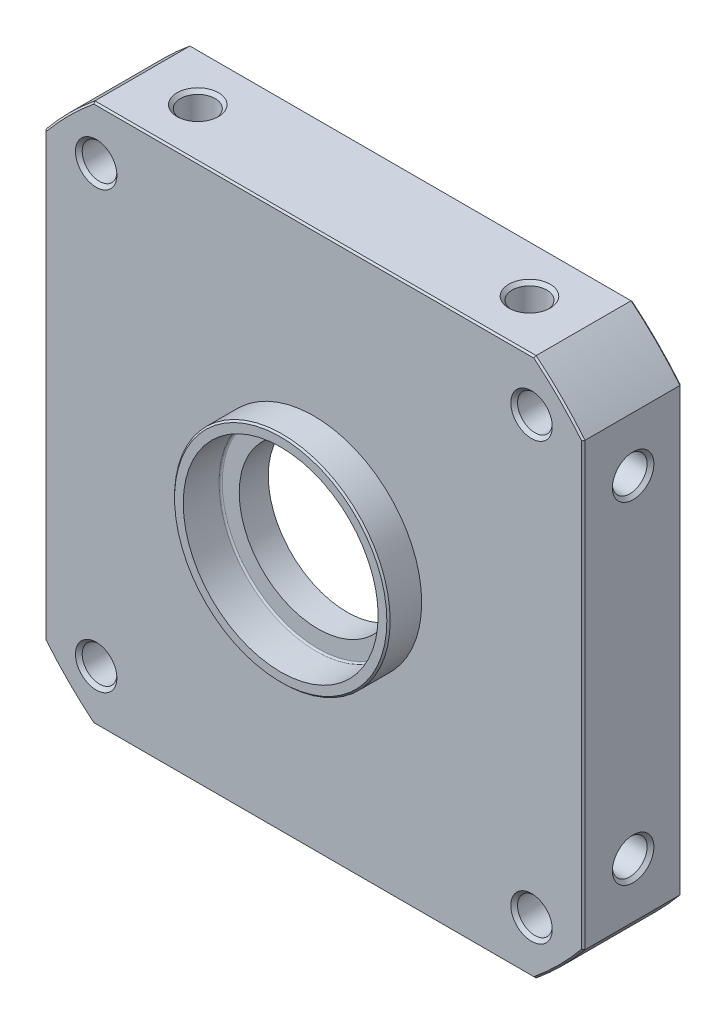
ISO-10303-21;
HEADER;
FILE_DESCRIPTION(('STEP AP214'),'2;1');
FILE_NAME('part.step','',(''),(''),'','','');
FILE_SCHEMA(('AUTOMOTIVE_DESIGN { 1 0 10303 214 1 1 1 1 }'));
ENDSEC;
DATA;
#1=APPLICATION_CONTEXT('core data for automotive mechanical design processes');
#2=APPLICATION_PROTOCOL_DEFINITION('international standard','automotive_design',2000,#1);
#3=PRODUCT_CONTEXT('',#1,'mechanical');
#4=PRODUCT('Part','Part','',(#3));
#5=PRODUCT_RELATED_PRODUCT_CATEGORY('part','',(#4));
#6=PRODUCT_DEFINITION_FORMATION('','',#4);
#7=PRODUCT_DEFINITION_CONTEXT('part definition',#1,'design');
#8=PRODUCT_DEFINITION('design','',#6,#7);
#9=PRODUCT_DEFINITION_SHAPE('','',#8);
#10=(LENGTH_UNIT() NAMED_UNIT(*) SI_UNIT(.MILLI.,.METRE.));
#11=(NAMED_UNIT(*) PLANE_ANGLE_UNIT() SI_UNIT($,.RADIAN.));
#12=(NAMED_UNIT(*) SI_UNIT($,.STERADIAN.) SOLID_ANGLE_UNIT());
#13=UNCERTAINTY_MEASURE_WITH_UNIT(LENGTH_MEASURE(1.E-05),#10,'distance_accuracy_value','');
#14=(GEOMETRIC_REPRESENTATION_CONTEXT(3) GLOBAL_UNCERTAINTY_ASSIGNED_CONTEXT((#13)) GLOBAL_UNIT_ASSIGNED_CONTEXT((#10,
#11,#12)) REPRESENTATION_CONTEXT('',''));
#15=CARTESIAN_POINT('',(0.,0.,0.));
#16=DIRECTION('',(0.,0.,1.));
#17=DIRECTION('',(1.,0.,0.));
#18=AXIS2_PLACEMENT_3D('',#15,#16,#17);
#19=CARTESIAN_POINT('',(-65.,53.207142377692,35.));
#20=DIRECTION('',(1.,0.,0.));
#21=DIRECTION('',(0.,0.,-1.));
#22=AXIS2_PLACEMENT_3D('',#19,#20,#21);
#23=PLANE('',#22);
#24=CARTESIAN_POINT('',(-65.,40.,15.));
#25=DIRECTION('',(-1.,0.,0.));
#26=DIRECTION('',(0.,0.,1.));
#27=AXIS2_PLACEMENT_3D('',#24,#25,#26);
#28=CIRCLE('',#27,5.);
#29=CARTESIAN_POINT('',(-65.,40.,20.));
#30=VERTEX_POINT('',#29);
#31=EDGE_CURVE('E289',#30,#30,#28,.T.);
#32=ORIENTED_EDGE('',*,*,#31,.F.);
#33=EDGE_LOOP('',(#32));
#34=FACE_BOUND('',#33,.T.);
#35=CARTESIAN_POINT('',(-65.,-40.,15.));
#36=DIRECTION('',(-1.,0.,0.));
#37=DIRECTION('',(0.,0.,1.));
#38=AXIS2_PLACEMENT_3D('',#35,#36,#37);
#39=CIRCLE('',#38,5.);
#40=CARTESIAN_POINT('',(-65.,-40.,20.));
#41=VERTEX_POINT('',#40);
#42=EDGE_CURVE('E280',#41,#41,#39,.T.);
#43=ORIENTED_EDGE('',*,*,#42,.F.);
#44=EDGE_LOOP('',(#43));
#45=FACE_BOUND('',#44,.T.);
#46=DIRECTION('',(0.,0.,-1.));
#47=VECTOR('',#46,1.);
#48=CARTESIAN_POINT('',(-65.,53.207142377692,35.));
#49=LINE('',#48,#47);
#50=CARTESIAN_POINT('',(-65.,53.2071423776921,26.6));
#51=VERTEX_POINT('',#50);
#52=CARTESIAN_POINT('',(-65.,53.207142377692,3.69999999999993));
#53=VERTEX_POINT('',#52);
#54=EDGE_CURVE('E214',#51,#53,#49,.T.);
#55=ORIENTED_EDGE('',*,*,#54,.T.);
#56=DIRECTION('',(0.,1.,0.));
#57=VECTOR('',#56,1.);
#58=CARTESIAN_POINT('',(-65.,-65.,3.7));
#59=LINE('',#58,#57);
#60=CARTESIAN_POINT('',(-65.,-53.2071423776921,3.7));
#61=VERTEX_POINT('',#60);
#62=EDGE_CURVE('E544',#61,#53,#59,.T.);
#63=ORIENTED_EDGE('',*,*,#62,.F.);
#64=DIRECTION('',(0.,0.,-1.));
#65=VECTOR('',#64,1.);
#66=CARTESIAN_POINT('',(-65.,-53.207142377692,35.));
#67=LINE('',#66,#65);
#68=CARTESIAN_POINT('',(-65.,-53.2071423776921,26.6));
#69=VERTEX_POINT('',#68);
#70=EDGE_CURVE('E211',#69,#61,#67,.T.);
#71=ORIENTED_EDGE('',*,*,#70,.F.);
#72=DIRECTION('',(0.,1.,0.));
#73=VECTOR('',#72,1.);
#74=CARTESIAN_POINT('',(-65.,-65.,26.6));
#75=LINE('',#74,#73);
#76=EDGE_CURVE('E539',#69,#51,#75,.T.);
#77=ORIENTED_EDGE('',*,*,#76,.T.);
#78=EDGE_LOOP('',(#55,#63,#71,#77));
#79=FACE_BOUND('',#78,.T.);
#80=ADVANCED_FACE('F33',(#34,#45,#79),#23,.F.);
#81=CARTESIAN_POINT('',(65.,-53.207142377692,35.));
#82=DIRECTION('',(-1.,0.,0.));
#83=DIRECTION('',(0.,0.,1.));
#84=AXIS2_PLACEMENT_3D('',#81,#82,#83);
#85=PLANE('',#84);
#86=CARTESIAN_POINT('',(65.,40.,15.));
#87=DIRECTION('',(1.,0.,0.));
#88=DIRECTION('',(0.,0.,-1.));
#89=AXIS2_PLACEMENT_3D('',#86,#87,#88);
#90=CIRCLE('',#89,5.);
#91=CARTESIAN_POINT('',(65.,40.,10.));
#92=VERTEX_POINT('',#91);
#93=EDGE_CURVE('E307',#92,#92,#90,.T.);
#94=ORIENTED_EDGE('',*,*,#93,.F.);
#95=EDGE_LOOP('',(#94));
#96=FACE_BOUND('',#95,.T.);
#97=CARTESIAN_POINT('',(65.,-40.,15.));
#98=DIRECTION('',(1.,0.,0.));
#99=DIRECTION('',(0.,0.,-1.));
#100=AXIS2_PLACEMENT_3D('',#97,#98,#99);
#101=CIRCLE('',#100,5.);
#102=CARTESIAN_POINT('',(65.,-40.,10.));
#103=VERTEX_POINT('',#102);
#104=EDGE_CURVE('E298',#103,#103,#101,.T.);
#105=ORIENTED_EDGE('',*,*,#104,.F.);
#106=EDGE_LOOP('',(#105));
#107=FACE_BOUND('',#106,.T.);
#108=DIRECTION('',(0.,0.,-1.));
#109=VECTOR('',#108,1.);
#110=CARTESIAN_POINT('',(65.,53.207142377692,35.));
#111=LINE('',#110,#109);
#112=CARTESIAN_POINT('',(65.,53.2071423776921,26.6));
#113=VERTEX_POINT('',#112);
#114=CARTESIAN_POINT('',(65.,53.2071423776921,3.7));
#115=VERTEX_POINT('',#114);
#116=EDGE_CURVE('E182',#113,#115,#111,.T.);
#117=ORIENTED_EDGE('',*,*,#116,.F.);
#118=DIRECTION('',(0.,1.,0.));
#119=VECTOR('',#118,1.);
#120=CARTESIAN_POINT('',(65.,-65.,26.6));
#121=LINE('',#120,#119);
#122=CARTESIAN_POINT('',(65.,-53.2071423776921,26.6));
#123=VERTEX_POINT('',#122);
#124=EDGE_CURVE('E167',#123,#113,#121,.T.);
#125=ORIENTED_EDGE('',*,*,#124,.F.);
#126=DIRECTION('',(0.,0.,-1.));
#127=VECTOR('',#126,1.);
#128=CARTESIAN_POINT('',(64.9999999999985,-53.2071423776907,35.));
#129=LINE('',#128,#127);
#130=CARTESIAN_POINT('',(64.9999999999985,-53.2071423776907,3.69999999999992));
#131=VERTEX_POINT('',#130);
#132=EDGE_CURVE('E180',#123,#131,#129,.T.);
#133=ORIENTED_EDGE('',*,*,#132,.T.);
#134=DIRECTION('',(0.,1.,0.));
#135=VECTOR('',#134,1.);
#136=CARTESIAN_POINT('',(65.,-65.,3.7));
#137=LINE('',#136,#135);
#138=EDGE_CURVE('E183',#131,#115,#137,.T.);
#139=ORIENTED_EDGE('',*,*,#138,.T.);
#140=EDGE_LOOP('',(#117,#125,#133,#139));
#141=FACE_BOUND('',#140,.T.);
#142=ADVANCED_FACE('F177',(#96,#107,#141),#85,.F.);
#143=CARTESIAN_POINT('',(53.207142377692,65.,35.));
#144=DIRECTION('',(0.,-1.,0.));
#145=DIRECTION('',(0.,0.,-1.));
#146=AXIS2_PLACEMENT_3D('',#143,#144,#145);
#147=PLANE('',#146);
#148=CARTESIAN_POINT('',(40.,65.,15.));
#149=DIRECTION('',(0.,1.,0.));
#150=DIRECTION('',(0.,0.,1.));
#151=AXIS2_PLACEMENT_3D('',#148,#149,#150);
#152=CIRCLE('',#151,5.);
#153=CARTESIAN_POINT('',(40.,65.,20.));
#154=VERTEX_POINT('',#153);
#155=EDGE_CURVE('E325',#154,#154,#152,.T.);
#156=ORIENTED_EDGE('',*,*,#155,.F.);
#157=EDGE_LOOP('',(#156));
#158=FACE_BOUND('',#157,.T.);
#159=CARTESIAN_POINT('',(-40.,65.,15.));
#160=DIRECTION('',(0.,1.,0.));
#161=DIRECTION('',(0.,0.,1.));
#162=AXIS2_PLACEMENT_3D('',#159,#160,#161);
#163=CIRCLE('',#162,5.);
#164=CARTESIAN_POINT('',(-40.,65.,20.));
#165=VERTEX_POINT('',#164);
#166=EDGE_CURVE('E316',#165,#165,#163,.T.);
#167=ORIENTED_EDGE('',*,*,#166,.F.);
#168=EDGE_LOOP('',(#167));
#169=FACE_BOUND('',#168,.T.);
#170=DIRECTION('',(0.,0.,-1.));
#171=VECTOR('',#170,1.);
#172=CARTESIAN_POINT('',(53.207142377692,65.,35.));
#173=LINE('',#172,#171);
#174=CARTESIAN_POINT('',(53.2071423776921,65.,26.6));
#175=VERTEX_POINT('',#174);
#176=CARTESIAN_POINT('',(53.2071423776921,65.,3.7));
#177=VERTEX_POINT('',#176);
#178=EDGE_CURVE('E205',#175,#177,#173,.T.);
#179=ORIENTED_EDGE('',*,*,#178,.T.);
#180=DIRECTION('',(1.,0.,0.));
#181=VECTOR('',#180,1.);
#182=CARTESIAN_POINT('',(-65.,65.,3.7));
#183=LINE('',#182,#181);
#184=CARTESIAN_POINT('',(-53.2071423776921,65.,3.7));
#185=VERTEX_POINT('',#184);
#186=EDGE_CURVE('E427',#185,#177,#183,.T.);
#187=ORIENTED_EDGE('',*,*,#186,.F.);
#188=DIRECTION('',(0.,0.,-1.));
#189=VECTOR('',#188,1.);
#190=CARTESIAN_POINT('',(-53.207142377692,65.,35.));
#191=LINE('',#190,#189);
#192=CARTESIAN_POINT('',(-53.207142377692,65.,26.6000000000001));
#193=VERTEX_POINT('',#192);
#194=EDGE_CURVE('E418',#193,#185,#191,.T.);
#195=ORIENTED_EDGE('',*,*,#194,.F.);
#196=DIRECTION('',(1.,0.,0.));
#197=VECTOR('',#196,1.);
#198=CARTESIAN_POINT('',(-65.,65.,26.6));
#199=LINE('',#198,#197);
#200=EDGE_CURVE('E429',#193,#175,#199,.T.);
#201=ORIENTED_EDGE('',*,*,#200,.T.);
#202=EDGE_LOOP('',(#179,#187,#195,#201));
#203=FACE_BOUND('',#202,.T.);
#204=ADVANCED_FACE('F425',(#158,#169,#203),#147,.F.);
#205=CARTESIAN_POINT('',(0.,26.,27.));
#206=DIRECTION('',(0.,0.,1.));
#207=DIRECTION('',(1.,0.,0.));
#208=AXIS2_PLACEMENT_3D('',#205,#206,#207);
#209=PLANE('',#208);
#210=DIRECTION('',(0.,1.,0.));
#211=VECTOR('',#210,1.);
#212=CARTESIAN_POINT('',(64.6,-65.,27.));
#213=LINE('',#212,#211);
#214=CARTESIAN_POINT('',(64.6,-53.064112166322,27.));
#215=VERTEX_POINT('',#214);
#216=CARTESIAN_POINT('',(64.6,53.064112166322,27.));
#217=VERTEX_POINT('',#216);
#218=EDGE_CURVE('E53',#215,#217,#213,.T.);
#219=ORIENTED_EDGE('',*,*,#218,.T.);
#220=CARTESIAN_POINT('',(0.,0.,27.));
#221=DIRECTION('',(0.,0.,1.));
#222=DIRECTION('',(1.,0.,0.));
#223=AXIS2_PLACEMENT_3D('',#220,#221,#222);
#224=CIRCLE('',#223,83.6);
#225=CARTESIAN_POINT('',(53.064112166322,64.6,27.));
#226=VERTEX_POINT('',#225);
#227=EDGE_CURVE('E270',#217,#226,#224,.T.);
#228=ORIENTED_EDGE('',*,*,#227,.T.);
#229=DIRECTION('',(1.,0.,0.));
#230=VECTOR('',#229,1.);
#231=CARTESIAN_POINT('',(-65.,64.6,27.));
#232=LINE('',#231,#230);
#233=CARTESIAN_POINT('',(-53.064112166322,64.6,27.));
#234=VERTEX_POINT('',#233);
#235=EDGE_CURVE('E252',#234,#226,#232,.T.);
#236=ORIENTED_EDGE('',*,*,#235,.F.);
#237=CARTESIAN_POINT('',(-64.6,53.064112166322,27.));
#238=VERTEX_POINT('',#237);
#239=EDGE_CURVE('E273',#234,#238,#224,.T.);
#240=ORIENTED_EDGE('',*,*,#239,.T.);
#241=DIRECTION('',(0.,1.,0.));
#242=VECTOR('',#241,1.);
#243=CARTESIAN_POINT('',(-64.6,-65.,27.));
#244=LINE('',#243,#242);
#245=CARTESIAN_POINT('',(-64.6,-53.064112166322,27.));
#246=VERTEX_POINT('',#245);
#247=EDGE_CURVE('E61',#246,#238,#244,.T.);
#248=ORIENTED_EDGE('',*,*,#247,.F.);
#249=CARTESIAN_POINT('',(-53.064112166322,-64.6,27.));
#250=VERTEX_POINT('',#249);
#251=EDGE_CURVE('E274',#246,#250,#224,.T.);
#252=ORIENTED_EDGE('',*,*,#251,.T.);
#253=DIRECTION('',(1.,0.,0.));
#254=VECTOR('',#253,1.);
#255=CARTESIAN_POINT('',(-65.,-64.6,27.));
#256=LINE('',#255,#254);
#257=CARTESIAN_POINT('',(53.064112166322,-64.6,27.));
#258=VERTEX_POINT('',#257);
#259=EDGE_CURVE('E475',#250,#258,#256,.T.);
#260=ORIENTED_EDGE('',*,*,#259,.T.);
#261=EDGE_CURVE('E268',#258,#215,#224,.T.);
#262=ORIENTED_EDGE('',*,*,#261,.T.);
#263=EDGE_LOOP('',(#219,#228,#236,#240,#248,#252,#260,#262));
#264=FACE_BOUND('',#263,.T.);
#265=CARTESIAN_POINT('',(52.5,-52.5,27.));
#266=DIRECTION('',(0.,0.,-1.));
#267=DIRECTION('',(-1.,0.,0.));
#268=AXIS2_PLACEMENT_3D('',#265,#266,#267);
#269=CIRCLE('',#268,5.);
#270=CARTESIAN_POINT('',(47.5,-52.5,27.));
#271=VERTEX_POINT('',#270);
#272=EDGE_CURVE('E340',#271,#271,#269,.T.);
#273=ORIENTED_EDGE('',*,*,#272,.T.);
#274=EDGE_LOOP('',(#273));
#275=FACE_BOUND('',#274,.T.);
#276=CARTESIAN_POINT('',(52.5,52.5,27.));
#277=DIRECTION('',(0.,0.,-1.));
#278=DIRECTION('',(-1.,0.,0.));
#279=AXIS2_PLACEMENT_3D('',#276,#277,#278);
#280=CIRCLE('',#279,5.);
#281=CARTESIAN_POINT('',(47.5,52.5,27.));
#282=VERTEX_POINT('',#281);
#283=EDGE_CURVE('E364',#282,#282,#280,.T.);
#284=ORIENTED_EDGE('',*,*,#283,.T.);
#285=EDGE_LOOP('',(#284));
#286=FACE_BOUND('',#285,.T.);
#287=CARTESIAN_POINT('',(0.,0.,27.));
#288=DIRECTION('',(0.,0.,1.));
#289=DIRECTION('',(1.,0.,0.));
#290=AXIS2_PLACEMENT_3D('',#287,#288,#289);
#291=CIRCLE('',#290,26.);
#292=CARTESIAN_POINT('',(26.,0.,27.));
#293=VERTEX_POINT('',#292);
#294=EDGE_CURVE('E385',#293,#293,#291,.T.);
#295=ORIENTED_EDGE('',*,*,#294,.F.);
#296=EDGE_LOOP('',(#295));
#297=FACE_BOUND('',#296,.T.);
#298=CARTESIAN_POINT('',(-52.5,52.5,27.));
#299=DIRECTION('',(0.,0.,-1.));
#300=DIRECTION('',(-1.,0.,0.));
#301=AXIS2_PLACEMENT_3D('',#298,#299,#300);
#302=CIRCLE('',#301,5.);
#303=CARTESIAN_POINT('',(-57.5,52.5,27.));
#304=VERTEX_POINT('',#303);
#305=EDGE_CURVE('E352',#304,#304,#302,.T.);
#306=ORIENTED_EDGE('',*,*,#305,.T.);
#307=EDGE_LOOP('',(#306));
#308=FACE_BOUND('',#307,.T.);
#309=CARTESIAN_POINT('',(-52.5,-52.5,27.));
#310=DIRECTION('',(0.,0.,-1.));
#311=DIRECTION('',(-1.,0.,0.));
#312=AXIS2_PLACEMENT_3D('',#309,#310,#311);
#313=CIRCLE('',#312,5.);
#314=CARTESIAN_POINT('',(-57.5,-52.5,27.));
#315=VERTEX_POINT('',#314);
#316=EDGE_CURVE('E328',#315,#315,#313,.T.);
#317=ORIENTED_EDGE('',*,*,#316,.T.);
#318=EDGE_LOOP('',(#317));
#319=FACE_BOUND('',#318,.T.);
#320=ADVANCED_FACE('F527',(#264,#275,#286,#297,#308,#319),#209,.T.);
#321=CARTESIAN_POINT('',(0.,101.,3.3));
#322=DIRECTION('',(0.,0.,-1.));
#323=DIRECTION('',(-1.,0.,0.));
#324=AXIS2_PLACEMENT_3D('',#321,#322,#323);
#325=PLANE('',#324);
#326=DIRECTION('',(0.,1.,0.));
#327=VECTOR('',#326,1.);
#328=CARTESIAN_POINT('',(64.6,-65.,3.3));
#329=LINE('',#328,#327);
#330=CARTESIAN_POINT('',(64.6,-53.064112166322,3.3));
#331=VERTEX_POINT('',#330);
#332=CARTESIAN_POINT('',(64.6,53.064112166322,3.3));
#333=VERTEX_POINT('',#332);
#334=EDGE_CURVE('E810',#331,#333,#329,.T.);
#335=ORIENTED_EDGE('',*,*,#334,.F.);
#336=CARTESIAN_POINT('',(0.,0.,3.3));
#337=DIRECTION('',(0.,0.,1.));
#338=DIRECTION('',(1.,0.,0.));
#339=AXIS2_PLACEMENT_3D('',#336,#337,#338);
#340=CIRCLE('',#339,83.6);
#341=CARTESIAN_POINT('',(53.064112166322,-64.6,3.3));
#342=VERTEX_POINT('',#341);
#343=EDGE_CURVE('E259',#342,#331,#340,.T.);
#344=ORIENTED_EDGE('',*,*,#343,.F.);
#345=DIRECTION('',(1.,0.,0.));
#346=VECTOR('',#345,1.);
#347=CARTESIAN_POINT('',(-65.,-64.6,3.3));
#348=LINE('',#347,#346);
#349=CARTESIAN_POINT('',(-53.064112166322,-64.6,3.3));
#350=VERTEX_POINT('',#349);
#351=EDGE_CURVE('E524',#350,#342,#348,.T.);
#352=ORIENTED_EDGE('',*,*,#351,.F.);
#353=CARTESIAN_POINT('',(-64.6,-53.064112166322,3.3));
#354=VERTEX_POINT('',#353);
#355=EDGE_CURVE('E263',#354,#350,#340,.T.);
#356=ORIENTED_EDGE('',*,*,#355,.F.);
#357=DIRECTION('',(0.,1.,0.));
#358=VECTOR('',#357,1.);
#359=CARTESIAN_POINT('',(-64.6,-65.,3.3));
#360=LINE('',#359,#358);
#361=CARTESIAN_POINT('',(-64.6,53.064112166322,3.3));
#362=VERTEX_POINT('',#361);
#363=EDGE_CURVE('E518',#354,#362,#360,.T.);
#364=ORIENTED_EDGE('',*,*,#363,.T.);
#365=CARTESIAN_POINT('',(-53.064112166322,64.6,3.3));
#366=VERTEX_POINT('',#365);
#367=EDGE_CURVE('E262',#366,#362,#340,.T.);
#368=ORIENTED_EDGE('',*,*,#367,.F.);
#369=DIRECTION('',(1.,0.,0.));
#370=VECTOR('',#369,1.);
#371=CARTESIAN_POINT('',(-65.,64.6,3.3));
#372=LINE('',#371,#370);
#373=CARTESIAN_POINT('',(53.064112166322,64.6,3.3));
#374=VERTEX_POINT('',#373);
#375=EDGE_CURVE('E251',#366,#374,#372,.T.);
#376=ORIENTED_EDGE('',*,*,#375,.T.);
#377=EDGE_CURVE('E260',#333,#374,#340,.T.);
#378=ORIENTED_EDGE('',*,*,#377,.F.);
#379=EDGE_LOOP('',(#335,#344,#352,#356,#364,#368,#376,#378));
#380=FACE_BOUND('',#379,.T.);
#381=CARTESIAN_POINT('',(52.5,-52.5,3.3));
#382=DIRECTION('',(0.,0.,-1.));
#383=DIRECTION('',(-1.,0.,0.));
#384=AXIS2_PLACEMENT_3D('',#381,#382,#383);
#385=CIRCLE('',#384,5.);
#386=CARTESIAN_POINT('',(47.5,-52.5,3.3));
#387=VERTEX_POINT('',#386);
#388=EDGE_CURVE('E349',#387,#387,#385,.T.);
#389=ORIENTED_EDGE('',*,*,#388,.F.);
#390=EDGE_LOOP('',(#389));
#391=FACE_BOUND('',#390,.T.);
#392=CARTESIAN_POINT('',(52.5,52.5,3.3));
#393=DIRECTION('',(0.,0.,-1.));
#394=DIRECTION('',(-1.,0.,0.));
#395=AXIS2_PLACEMENT_3D('',#392,#393,#394);
#396=CIRCLE('',#395,5.);
#397=CARTESIAN_POINT('',(47.5,52.5,3.3));
#398=VERTEX_POINT('',#397);
#399=EDGE_CURVE('E373',#398,#398,#396,.T.);
#400=ORIENTED_EDGE('',*,*,#399,.F.);
#401=EDGE_LOOP('',(#400));
#402=FACE_BOUND('',#401,.T.);
#403=CARTESIAN_POINT('',(0.,0.,3.3));
#404=DIRECTION('',(0.,0.,1.));
#405=DIRECTION('',(1.,0.,0.));
#406=AXIS2_PLACEMENT_3D('',#403,#404,#405);
#407=CIRCLE('',#406,51.);
#408=CARTESIAN_POINT('',(51.,0.,3.3));
#409=VERTEX_POINT('',#408);
#410=EDGE_CURVE('E382',#409,#409,#407,.T.);
#411=ORIENTED_EDGE('',*,*,#410,.T.);
#412=EDGE_LOOP('',(#411));
#413=FACE_BOUND('',#412,.T.);
#414=CARTESIAN_POINT('',(-52.5,52.5,3.3));
#415=DIRECTION('',(0.,0.,-1.));
#416=DIRECTION('',(-1.,0.,0.));
#417=AXIS2_PLACEMENT_3D('',#414,#415,#416);
#418=CIRCLE('',#417,5.);
#419=CARTESIAN_POINT('',(-57.5,52.5,3.3));
#420=VERTEX_POINT('',#419);
#421=EDGE_CURVE('E361',#420,#420,#418,.T.);
#422=ORIENTED_EDGE('',*,*,#421,.F.);
#423=EDGE_LOOP('',(#422));
#424=FACE_BOUND('',#423,.T.);
#425=CARTESIAN_POINT('',(-52.5,-52.5,3.3));
#426=DIRECTION('',(0.,0.,-1.));
#427=DIRECTION('',(-1.,0.,0.));
#428=AXIS2_PLACEMENT_3D('',#425,#426,#427);
#429=CIRCLE('',#428,5.);
#430=CARTESIAN_POINT('',(-57.5,-52.5,3.3));
#431=VERTEX_POINT('',#430);
#432=EDGE_CURVE('E337',#431,#431,#429,.T.);
#433=ORIENTED_EDGE('',*,*,#432,.F.);
#434=EDGE_LOOP('',(#433));
#435=FACE_BOUND('',#434,.T.);
#436=ADVANCED_FACE('F446',(#380,#391,#402,#413,#424,#435),#325,.T.);
#437=CARTESIAN_POINT('',(-1.41830991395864E-11,-1.41969769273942E-11,35.));
#438=DIRECTION('',(0.,0.,-1.));
#439=DIRECTION('',(-1.,0.,0.));
#440=AXIS2_PLACEMENT_3D('',#437,#438,#439);
#441=CYLINDRICAL_SURFACE('',#440,83.9999999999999);
#442=CARTESIAN_POINT('',(0.,0.,26.6));
#443=DIRECTION('',(0.,0.,1.));
#444=DIRECTION('',(1.,0.,0.));
#445=AXIS2_PLACEMENT_3D('',#442,#443,#444);
#446=CIRCLE('',#445,84.);
#447=EDGE_CURVE('E269',#193,#51,#446,.T.);
#448=ORIENTED_EDGE('',*,*,#447,.F.);
#449=ORIENTED_EDGE('',*,*,#194,.T.);
#450=CARTESIAN_POINT('',(0.,0.,3.7));
#451=DIRECTION('',(0.,0.,1.));
#452=DIRECTION('',(1.,0.,0.));
#453=AXIS2_PLACEMENT_3D('',#450,#451,#452);
#454=CIRCLE('',#453,84.);
#455=EDGE_CURVE('E265',#185,#53,#454,.T.);
#456=ORIENTED_EDGE('',*,*,#455,.T.);
#457=ORIENTED_EDGE('',*,*,#54,.F.);
#458=EDGE_LOOP('',(#448,#449,#456,#457));
#459=FACE_BOUND('',#458,.T.);
#460=ADVANCED_FACE('F35',(#459),#441,.T.);
#461=CARTESIAN_POINT('',(-1.41830991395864E-11,-1.41969769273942E-11,35.));
#462=DIRECTION('',(0.,0.,-1.));
#463=DIRECTION('',(-1.,0.,0.));
#464=AXIS2_PLACEMENT_3D('',#461,#462,#463);
#465=CYLINDRICAL_SURFACE('',#464,83.99999999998);
#466=CARTESIAN_POINT('',(-53.2071423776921,-65.,26.6));
#467=VERTEX_POINT('',#466);
#468=EDGE_CURVE('E193',#69,#467,#446,.T.);
#469=ORIENTED_EDGE('',*,*,#468,.F.);
#470=ORIENTED_EDGE('',*,*,#70,.T.);
#471=CARTESIAN_POINT('',(-53.2071423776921,-65.,3.7));
#472=VERTEX_POINT('',#471);
#473=EDGE_CURVE('E806',#61,#472,#454,.T.);
#474=ORIENTED_EDGE('',*,*,#473,.T.);
#475=DIRECTION('',(0.,0.,-1.));
#476=VECTOR('',#475,1.);
#477=CARTESIAN_POINT('',(-53.207142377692,-65.,35.));
#478=LINE('',#477,#476);
#479=EDGE_CURVE('E203',#467,#472,#478,.T.);
#480=ORIENTED_EDGE('',*,*,#479,.F.);
#481=EDGE_LOOP('',(#469,#470,#474,#480));
#482=FACE_BOUND('',#481,.T.);
#483=ADVANCED_FACE('F583',(#482),#465,.T.);
#484=CARTESIAN_POINT('',(-53.207142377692,-65.,35.));
#485=DIRECTION('',(0.,1.,0.));
#486=DIRECTION('',(0.,0.,1.));
#487=AXIS2_PLACEMENT_3D('',#484,#485,#486);
#488=PLANE('',#487);
#489=DIRECTION('',(0.,0.,-1.));
#490=VECTOR('',#489,1.);
#491=CARTESIAN_POINT('',(53.207142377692,-65.,35.));
#492=LINE('',#491,#490);
#493=CARTESIAN_POINT('',(53.2071423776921,-65.,26.6));
#494=VERTEX_POINT('',#493);
#495=CARTESIAN_POINT('',(53.2071423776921,-65.,3.7));
#496=VERTEX_POINT('',#495);
#497=EDGE_CURVE('E201',#494,#496,#492,.T.);
#498=ORIENTED_EDGE('',*,*,#497,.F.);
#499=DIRECTION('',(1.,0.,0.));
#500=VECTOR('',#499,1.);
#501=CARTESIAN_POINT('',(-65.,-65.,26.6));
#502=LINE('',#501,#500);
#503=EDGE_CURVE('E465',#467,#494,#502,.T.);
#504=ORIENTED_EDGE('',*,*,#503,.F.);
#505=ORIENTED_EDGE('',*,*,#479,.T.);
#506=DIRECTION('',(1.,0.,0.));
#507=VECTOR('',#506,1.);
#508=CARTESIAN_POINT('',(-65.,-65.,3.7));
#509=LINE('',#508,#507);
#510=EDGE_CURVE('E469',#472,#496,#509,.T.);
#511=ORIENTED_EDGE('',*,*,#510,.T.);
#512=EDGE_LOOP('',(#498,#504,#505,#511));
#513=FACE_BOUND('',#512,.T.);
#514=ADVANCED_FACE('F586',(#513),#488,.F.);
#515=CARTESIAN_POINT('',(-1.41830991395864E-11,-1.41969769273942E-11,35.));
#516=DIRECTION('',(0.,0.,-1.));
#517=DIRECTION('',(-1.,0.,0.));
#518=AXIS2_PLACEMENT_3D('',#515,#516,#517);
#519=CYLINDRICAL_SURFACE('',#518,83.9999999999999);
#520=EDGE_CURVE('E187',#494,#123,#446,.T.);
#521=ORIENTED_EDGE('',*,*,#520,.F.);
#522=ORIENTED_EDGE('',*,*,#497,.T.);
#523=EDGE_CURVE('E200',#496,#131,#454,.T.);
#524=ORIENTED_EDGE('',*,*,#523,.T.);
#525=ORIENTED_EDGE('',*,*,#132,.F.);
#526=EDGE_LOOP('',(#521,#522,#524,#525));
#527=FACE_BOUND('',#526,.T.);
#528=ADVANCED_FACE('F198',(#527),#519,.T.);
#529=CARTESIAN_POINT('',(-1.41830991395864E-11,-1.41969769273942E-11,35.));
#530=DIRECTION('',(0.,0.,-1.));
#531=DIRECTION('',(-1.,0.,0.));
#532=AXIS2_PLACEMENT_3D('',#529,#530,#531);
#533=CYLINDRICAL_SURFACE('',#532,84.0000000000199);
#534=EDGE_CURVE('E196',#113,#175,#446,.T.);
#535=ORIENTED_EDGE('',*,*,#534,.F.);
#536=ORIENTED_EDGE('',*,*,#116,.T.);
#537=EDGE_CURVE('E194',#115,#177,#454,.T.);
#538=ORIENTED_EDGE('',*,*,#537,.T.);
#539=ORIENTED_EDGE('',*,*,#178,.F.);
#540=EDGE_LOOP('',(#535,#536,#538,#539));
#541=FACE_BOUND('',#540,.T.);
#542=ADVANCED_FACE('F432',(#541),#533,.T.);
#543=CARTESIAN_POINT('',(-1.41830991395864E-11,-1.41969769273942E-11,0.));
#544=DIRECTION('',(0.,0.,1.));
#545=DIRECTION('',(1.,0.,0.));
#546=AXIS2_PLACEMENT_3D('',#543,#544,#545);
#547=PLANE('',#546);
#548=CARTESIAN_POINT('',(0.,0.,0.));
#549=DIRECTION('',(0.,0.,-1.));
#550=DIRECTION('',(-1.,0.,0.));
#551=AXIS2_PLACEMENT_3D('',#548,#549,#550);
#552=CIRCLE('',#551,49.);
#553=CARTESIAN_POINT('',(-49.,0.,0.));
#554=VERTEX_POINT('',#553);
#555=EDGE_CURVE('E415',#554,#554,#552,.T.);
#556=ORIENTED_EDGE('',*,*,#555,.F.);
#557=EDGE_LOOP('',(#556));
#558=FACE_BOUND('',#557,.T.);
#559=CARTESIAN_POINT('',(0.,0.,0.));
#560=DIRECTION('',(0.,0.,1.));
#561=DIRECTION('',(1.,0.,0.));
#562=AXIS2_PLACEMENT_3D('',#559,#560,#561);
#563=CIRCLE('',#562,50.7);
#564=CARTESIAN_POINT('',(50.7,0.,0.));
#565=VERTEX_POINT('',#564);
#566=EDGE_CURVE('E376',#565,#565,#563,.T.);
#567=ORIENTED_EDGE('',*,*,#566,.F.);
#568=EDGE_LOOP('',(#567));
#569=FACE_BOUND('',#568,.T.);
#570=ADVANCED_FACE('F595',(#558,#569),#547,.F.);
#571=CARTESIAN_POINT('',(-1.41830991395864E-11,-1.41969769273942E-11,35.));
#572=DIRECTION('',(0.,0.,1.));
#573=DIRECTION('',(1.,0.,0.));
#574=AXIS2_PLACEMENT_3D('',#571,#572,#573);
#575=PLANE('',#574);
#576=CARTESIAN_POINT('',(0.,0.,35.));
#577=DIRECTION('',(0.,0.,-1.));
#578=DIRECTION('',(-1.,0.,0.));
#579=AXIS2_PLACEMENT_3D('',#576,#577,#578);
#580=CIRCLE('',#579,23.5);
#581=CARTESIAN_POINT('',(-23.5,0.,35.));
#582=VERTEX_POINT('',#581);
#583=EDGE_CURVE('E394',#582,#582,#580,.T.);
#584=ORIENTED_EDGE('',*,*,#583,.T.);
#585=EDGE_LOOP('',(#584));
#586=FACE_BOUND('',#585,.T.);
#587=CARTESIAN_POINT('',(0.,0.,35.));
#588=DIRECTION('',(0.,0.,1.));
#589=DIRECTION('',(1.,0.,0.));
#590=AXIS2_PLACEMENT_3D('',#587,#588,#589);
#591=CIRCLE('',#590,25.6);
#592=CARTESIAN_POINT('',(25.6,0.,35.));
#593=VERTEX_POINT('',#592);
#594=EDGE_CURVE('E391',#593,#593,#591,.T.);
#595=ORIENTED_EDGE('',*,*,#594,.T.);
#596=EDGE_LOOP('',(#595));
#597=FACE_BOUND('',#596,.T.);
#598=ADVANCED_FACE('F601',(#586,#597),#575,.T.);
#599=CARTESIAN_POINT('',(0.,0.,35.));
#600=DIRECTION('',(0.,0.,-1.));
#601=DIRECTION('',(-1.,0.,0.));
#602=AXIS2_PLACEMENT_3D('',#599,#600,#601);
#603=CYLINDRICAL_SURFACE('',#602,49.);
#604=ORIENTED_EDGE('',*,*,#555,.T.);
#605=EDGE_LOOP('',(#604));
#606=FACE_BOUND('',#605,.T.);
#607=CARTESIAN_POINT('',(0.,0.,14.9999999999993));
#608=DIRECTION('',(0.,0.,-1.));
#609=DIRECTION('',(-1.,0.,0.));
#610=AXIS2_PLACEMENT_3D('',#607,#608,#609);
#611=CIRCLE('',#610,49.);
#612=CARTESIAN_POINT('',(-49.,0.,14.9999999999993));
#613=VERTEX_POINT('',#612);
#614=EDGE_CURVE('E412',#613,#613,#611,.T.);
#615=ORIENTED_EDGE('',*,*,#614,.F.);
#616=EDGE_LOOP('',(#615));
#617=FACE_BOUND('',#616,.T.);
#618=ADVANCED_FACE('F605',(#606,#617),#603,.F.);
#619=CARTESIAN_POINT('',(0.,0.,14.9999999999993));
#620=DIRECTION('',(0.,0.,-1.));
#621=DIRECTION('',(-1.,0.,0.));
#622=AXIS2_PLACEMENT_3D('',#619,#620,#621);
#623=TOROIDAL_SURFACE('',#622,44.9999999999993,4.00000000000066);
#624=ORIENTED_EDGE('',*,*,#614,.T.);
#625=EDGE_LOOP('',(#624));
#626=FACE_BOUND('',#625,.T.);
#627=CARTESIAN_POINT('',(0.,0.,19.));
#628=DIRECTION('',(0.,0.,-1.));
#629=DIRECTION('',(-1.,0.,0.));
#630=AXIS2_PLACEMENT_3D('',#627,#628,#629);
#631=CIRCLE('',#630,44.9999999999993);
#632=CARTESIAN_POINT('',(-44.9999999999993,0.,19.));
#633=VERTEX_POINT('',#632);
#634=EDGE_CURVE('E409',#633,#633,#631,.T.);
#635=ORIENTED_EDGE('',*,*,#634,.F.);
#636=EDGE_LOOP('',(#635));
#637=FACE_BOUND('',#636,.T.);
#638=ADVANCED_FACE('F609',(#626,#637),#623,.F.);
#639=CARTESIAN_POINT('',(0.,-44.9999999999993,19.));
#640=DIRECTION('',(0.,0.,-1.));
#641=DIRECTION('',(-1.,0.,0.));
#642=AXIS2_PLACEMENT_3D('',#639,#640,#641);
#643=PLANE('',#642);
#644=ORIENTED_EDGE('',*,*,#634,.T.);
#645=EDGE_LOOP('',(#644));
#646=FACE_BOUND('',#645,.T.);
#647=CARTESIAN_POINT('',(0.,0.,19.));
#648=DIRECTION('',(0.,0.,-1.));
#649=DIRECTION('',(-1.,0.,0.));
#650=AXIS2_PLACEMENT_3D('',#647,#648,#649);
#651=CIRCLE('',#650,19.);
#652=CARTESIAN_POINT('',(-19.,0.,19.));
#653=VERTEX_POINT('',#652);
#654=EDGE_CURVE('E406',#653,#653,#651,.T.);
#655=ORIENTED_EDGE('',*,*,#654,.F.);
#656=EDGE_LOOP('',(#655));
#657=FACE_BOUND('',#656,.T.);
#658=ADVANCED_FACE('F613',(#646,#657),#643,.T.);
#659=CARTESIAN_POINT('',(0.,0.,35.));
#660=DIRECTION('',(0.,0.,-1.));
#661=DIRECTION('',(-1.,0.,0.));
#662=AXIS2_PLACEMENT_3D('',#659,#660,#661);
#663=CYLINDRICAL_SURFACE('',#662,19.);
#664=ORIENTED_EDGE('',*,*,#654,.T.);
#665=EDGE_LOOP('',(#664));
#666=FACE_BOUND('',#665,.T.);
#667=CARTESIAN_POINT('',(0.,0.,26.));
#668=DIRECTION('',(0.,0.,-1.));
#669=DIRECTION('',(-1.,0.,0.));
#670=AXIS2_PLACEMENT_3D('',#667,#668,#669);
#671=CIRCLE('',#670,19.);
#672=CARTESIAN_POINT('',(-19.,0.,26.));
#673=VERTEX_POINT('',#672);
#674=EDGE_CURVE('E403',#673,#673,#671,.T.);
#675=ORIENTED_EDGE('',*,*,#674,.F.);
#676=EDGE_LOOP('',(#675));
#677=FACE_BOUND('',#676,.T.);
#678=ADVANCED_FACE('F617',(#666,#677),#663,.F.);
#679=CARTESIAN_POINT('',(0.,-19.,26.));
#680=DIRECTION('',(0.,0.,1.));
#681=DIRECTION('',(1.,0.,0.));
#682=AXIS2_PLACEMENT_3D('',#679,#680,#681);
#683=PLANE('',#682);
#684=ORIENTED_EDGE('',*,*,#674,.T.);
#685=EDGE_LOOP('',(#684));
#686=FACE_BOUND('',#685,.T.);
#687=CARTESIAN_POINT('',(0.,0.,26.));
#688=DIRECTION('',(0.,0.,-1.));
#689=DIRECTION('',(-1.,0.,0.));
#690=AXIS2_PLACEMENT_3D('',#687,#688,#689);
#691=CIRCLE('',#690,23.1000000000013);
#692=CARTESIAN_POINT('',(-23.1000000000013,0.,26.));
#693=VERTEX_POINT('',#692);
#694=EDGE_CURVE('E400',#693,#693,#691,.T.);
#695=ORIENTED_EDGE('',*,*,#694,.F.);
#696=EDGE_LOOP('',(#695));
#697=FACE_BOUND('',#696,.T.);
#698=ADVANCED_FACE('F621',(#686,#697),#683,.T.);
#699=CARTESIAN_POINT('',(0.,0.,26.3999999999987));
#700=DIRECTION('',(0.,0.,-1.));
#701=DIRECTION('',(-1.,0.,0.));
#702=AXIS2_PLACEMENT_3D('',#699,#700,#701);
#703=TOROIDAL_SURFACE('',#702,23.1000000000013,0.39999999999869);
#704=ORIENTED_EDGE('',*,*,#694,.T.);
#705=EDGE_LOOP('',(#704));
#706=FACE_BOUND('',#705,.T.);
#707=CARTESIAN_POINT('',(0.,0.,26.3999999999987));
#708=DIRECTION('',(0.,0.,-1.));
#709=DIRECTION('',(-1.,0.,0.));
#710=AXIS2_PLACEMENT_3D('',#707,#708,#709);
#711=CIRCLE('',#710,23.5);
#712=CARTESIAN_POINT('',(-23.5,0.,26.3999999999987));
#713=VERTEX_POINT('',#712);
#714=EDGE_CURVE('E397',#713,#713,#711,.T.);
#715=ORIENTED_EDGE('',*,*,#714,.F.);
#716=EDGE_LOOP('',(#715));
#717=FACE_BOUND('',#716,.T.);
#718=ADVANCED_FACE('F625',(#706,#717),#703,.F.);
#719=CARTESIAN_POINT('',(0.,0.,35.));
#720=DIRECTION('',(0.,0.,-1.));
#721=DIRECTION('',(-1.,0.,0.));
#722=AXIS2_PLACEMENT_3D('',#719,#720,#721);
#723=CYLINDRICAL_SURFACE('',#722,23.5);
#724=ORIENTED_EDGE('',*,*,#714,.T.);
#725=EDGE_LOOP('',(#724));
#726=FACE_BOUND('',#725,.T.);
#727=ORIENTED_EDGE('',*,*,#583,.F.);
#728=EDGE_LOOP('',(#727));
#729=FACE_BOUND('',#728,.T.);
#730=ADVANCED_FACE('F629',(#726,#729),#723,.F.);
#731=CARTESIAN_POINT('',(0.,0.,35.));
#732=DIRECTION('',(0.,0.,-1.));
#733=DIRECTION('',(-1.,0.,0.));
#734=AXIS2_PLACEMENT_3D('',#731,#732,#733);
#735=CONICAL_SURFACE('',#734,25.6,0.785398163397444);
#736=CARTESIAN_POINT('',(0.,0.,34.6));
#737=DIRECTION('',(0.,0.,1.));
#738=DIRECTION('',(1.,0.,0.));
#739=AXIS2_PLACEMENT_3D('',#736,#737,#738);
#740=CIRCLE('',#739,26.);
#741=CARTESIAN_POINT('',(26.,0.,34.6));
#742=VERTEX_POINT('',#741);
#743=EDGE_CURVE('E388',#742,#742,#740,.T.);
#744=ORIENTED_EDGE('',*,*,#743,.T.);
#745=EDGE_LOOP('',(#744));
#746=FACE_BOUND('',#745,.T.);
#747=ORIENTED_EDGE('',*,*,#594,.F.);
#748=EDGE_LOOP('',(#747));
#749=FACE_BOUND('',#748,.T.);
#750=ADVANCED_FACE('F633',(#746,#749),#735,.T.);
#751=CARTESIAN_POINT('',(0.,0.,-25.));
#752=DIRECTION('',(0.,0.,1.));
#753=DIRECTION('',(1.,0.,0.));
#754=AXIS2_PLACEMENT_3D('',#751,#752,#753);
#755=CYLINDRICAL_SURFACE('',#754,26.);
#756=ORIENTED_EDGE('',*,*,#294,.T.);
#757=EDGE_LOOP('',(#756));
#758=FACE_BOUND('',#757,.T.);
#759=ORIENTED_EDGE('',*,*,#743,.F.);
#760=EDGE_LOOP('',(#759));
#761=FACE_BOUND('',#760,.T.);
#762=ADVANCED_FACE('F637',(#758,#761),#755,.T.);
#763=CARTESIAN_POINT('',(0.,0.,-20.));
#764=DIRECTION('',(0.,0.,1.));
#765=DIRECTION('',(1.,0.,0.));
#766=AXIS2_PLACEMENT_3D('',#763,#764,#765);
#767=CYLINDRICAL_SURFACE('',#766,51.);
#768=CARTESIAN_POINT('',(0.,0.,0.300000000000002));
#769=DIRECTION('',(0.,0.,1.));
#770=DIRECTION('',(1.,0.,0.));
#771=AXIS2_PLACEMENT_3D('',#768,#769,#770);
#772=CIRCLE('',#771,51.);
#773=CARTESIAN_POINT('',(51.,0.,0.300000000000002));
#774=VERTEX_POINT('',#773);
#775=EDGE_CURVE('E379',#774,#774,#772,.T.);
#776=ORIENTED_EDGE('',*,*,#775,.T.);
#777=EDGE_LOOP('',(#776));
#778=FACE_BOUND('',#777,.T.);
#779=ORIENTED_EDGE('',*,*,#410,.F.);
#780=EDGE_LOOP('',(#779));
#781=FACE_BOUND('',#780,.T.);
#782=ADVANCED_FACE('F641',(#778,#781),#767,.T.);
#783=CARTESIAN_POINT('',(0.,0.,0.300000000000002));
#784=DIRECTION('',(0.,0.,1.));
#785=DIRECTION('',(1.,0.,0.));
#786=AXIS2_PLACEMENT_3D('',#783,#784,#785);
#787=CONICAL_SURFACE('',#786,51.,0.785398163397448);
#788=ORIENTED_EDGE('',*,*,#566,.T.);
#789=EDGE_LOOP('',(#788));
#790=FACE_BOUND('',#789,.T.);
#791=ORIENTED_EDGE('',*,*,#775,.F.);
#792=EDGE_LOOP('',(#791));
#793=FACE_BOUND('',#792,.T.);
#794=ADVANCED_FACE('F649',(#790,#793),#787,.T.);
#795=CARTESIAN_POINT('',(52.5,52.5,4.112));
#796=DIRECTION('',(0.,0.,-1.));
#797=DIRECTION('',(-1.,0.,0.));
#798=AXIS2_PLACEMENT_3D('',#795,#796,#797);
#799=CONICAL_SURFACE('',#798,4.188,0.785398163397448);
#800=ORIENTED_EDGE('',*,*,#399,.T.);
#801=EDGE_LOOP('',(#800));
#802=FACE_BOUND('',#801,.T.);
#803=CARTESIAN_POINT('',(52.5,52.5,4.112));
#804=DIRECTION('',(0.,0.,-1.));
#805=DIRECTION('',(-1.,0.,0.));
#806=AXIS2_PLACEMENT_3D('',#803,#804,#805);
#807=CIRCLE('',#806,4.188);
#808=CARTESIAN_POINT('',(48.312,52.5,4.112));
#809=VERTEX_POINT('',#808);
#810=EDGE_CURVE('E370',#809,#809,#807,.T.);
#811=ORIENTED_EDGE('',*,*,#810,.F.);
#812=EDGE_LOOP('',(#811));
#813=FACE_BOUND('',#812,.T.);
#814=ADVANCED_FACE('F653',(#802,#813),#799,.F.);
#815=CARTESIAN_POINT('',(52.5,52.5,27.));
#816=DIRECTION('',(0.,0.,-1.));
#817=DIRECTION('',(-1.,0.,0.));
#818=AXIS2_PLACEMENT_3D('',#815,#816,#817);
#819=CYLINDRICAL_SURFACE('',#818,4.188);
#820=ORIENTED_EDGE('',*,*,#810,.T.);
#821=EDGE_LOOP('',(#820));
#822=FACE_BOUND('',#821,.T.);
#823=CARTESIAN_POINT('',(52.5,52.5,26.188));
#824=DIRECTION('',(0.,0.,-1.));
#825=DIRECTION('',(-1.,0.,0.));
#826=AXIS2_PLACEMENT_3D('',#823,#824,#825);
#827=CIRCLE('',#826,4.188);
#828=CARTESIAN_POINT('',(48.312,52.5,26.188));
#829=VERTEX_POINT('',#828);
#830=EDGE_CURVE('E367',#829,#829,#827,.T.);
#831=ORIENTED_EDGE('',*,*,#830,.F.);
#832=EDGE_LOOP('',(#831));
#833=FACE_BOUND('',#832,.T.);
#834=ADVANCED_FACE('F657',(#822,#833),#819,.F.);
#835=CARTESIAN_POINT('',(52.5,52.5,27.));
#836=DIRECTION('',(0.,0.,1.));
#837=DIRECTION('',(1.,0.,0.));
#838=AXIS2_PLACEMENT_3D('',#835,#836,#837);
#839=CONICAL_SURFACE('',#838,5.,0.785398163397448);
#840=ORIENTED_EDGE('',*,*,#830,.T.);
#841=EDGE_LOOP('',(#840));
#842=FACE_BOUND('',#841,.T.);
#843=ORIENTED_EDGE('',*,*,#283,.F.);
#844=EDGE_LOOP('',(#843));
#845=FACE_BOUND('',#844,.T.);
#846=ADVANCED_FACE('F661',(#842,#845),#839,.F.);
#847=CARTESIAN_POINT('',(-52.5,52.5,4.112));
#848=DIRECTION('',(0.,0.,-1.));
#849=DIRECTION('',(-1.,0.,0.));
#850=AXIS2_PLACEMENT_3D('',#847,#848,#849);
#851=CONICAL_SURFACE('',#850,4.188,0.785398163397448);
#852=ORIENTED_EDGE('',*,*,#421,.T.);
#853=EDGE_LOOP('',(#852));
#854=FACE_BOUND('',#853,.T.);
#855=CARTESIAN_POINT('',(-52.5,52.5,4.112));
#856=DIRECTION('',(0.,0.,-1.));
#857=DIRECTION('',(-1.,0.,0.));
#858=AXIS2_PLACEMENT_3D('',#855,#856,#857);
#859=CIRCLE('',#858,4.188);
#860=CARTESIAN_POINT('',(-56.688,52.5,4.112));
#861=VERTEX_POINT('',#860);
#862=EDGE_CURVE('E358',#861,#861,#859,.T.);
#863=ORIENTED_EDGE('',*,*,#862,.F.);
#864=EDGE_LOOP('',(#863));
#865=FACE_BOUND('',#864,.T.);
#866=ADVANCED_FACE('F665',(#854,#865),#851,.F.);
#867=CARTESIAN_POINT('',(-52.5,52.5,27.));
#868=DIRECTION('',(0.,0.,-1.));
#869=DIRECTION('',(-1.,0.,0.));
#870=AXIS2_PLACEMENT_3D('',#867,#868,#869);
#871=CYLINDRICAL_SURFACE('',#870,4.188);
#872=ORIENTED_EDGE('',*,*,#862,.T.);
#873=EDGE_LOOP('',(#872));
#874=FACE_BOUND('',#873,.T.);
#875=CARTESIAN_POINT('',(-52.5,52.5,26.188));
#876=DIRECTION('',(0.,0.,-1.));
#877=DIRECTION('',(-1.,0.,0.));
#878=AXIS2_PLACEMENT_3D('',#875,#876,#877);
#879=CIRCLE('',#878,4.188);
#880=CARTESIAN_POINT('',(-56.688,52.5,26.188));
#881=VERTEX_POINT('',#880);
#882=EDGE_CURVE('E355',#881,#881,#879,.T.);
#883=ORIENTED_EDGE('',*,*,#882,.F.);
#884=EDGE_LOOP('',(#883));
#885=FACE_BOUND('',#884,.T.);
#886=ADVANCED_FACE('F669',(#874,#885),#871,.F.);
#887=CARTESIAN_POINT('',(-52.5,52.5,27.));
#888=DIRECTION('',(0.,0.,1.));
#889=DIRECTION('',(1.,0.,0.));
#890=AXIS2_PLACEMENT_3D('',#887,#888,#889);
#891=CONICAL_SURFACE('',#890,5.,0.785398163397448);
#892=ORIENTED_EDGE('',*,*,#882,.T.);
#893=EDGE_LOOP('',(#892));
#894=FACE_BOUND('',#893,.T.);
#895=ORIENTED_EDGE('',*,*,#305,.F.);
#896=EDGE_LOOP('',(#895));
#897=FACE_BOUND('',#896,.T.);
#898=ADVANCED_FACE('F673',(#894,#897),#891,.F.);
#899=CARTESIAN_POINT('',(52.5,-52.5,4.112));
#900=DIRECTION('',(0.,0.,-1.));
#901=DIRECTION('',(-1.,0.,0.));
#902=AXIS2_PLACEMENT_3D('',#899,#900,#901);
#903=CONICAL_SURFACE('',#902,4.188,0.785398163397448);
#904=ORIENTED_EDGE('',*,*,#388,.T.);
#905=EDGE_LOOP('',(#904));
#906=FACE_BOUND('',#905,.T.);
#907=CARTESIAN_POINT('',(52.5,-52.5,4.112));
#908=DIRECTION('',(0.,0.,-1.));
#909=DIRECTION('',(-1.,0.,0.));
#910=AXIS2_PLACEMENT_3D('',#907,#908,#909);
#911=CIRCLE('',#910,4.188);
#912=CARTESIAN_POINT('',(48.312,-52.5,4.112));
#913=VERTEX_POINT('',#912);
#914=EDGE_CURVE('E346',#913,#913,#911,.T.);
#915=ORIENTED_EDGE('',*,*,#914,.F.);
#916=EDGE_LOOP('',(#915));
#917=FACE_BOUND('',#916,.T.);
#918=ADVANCED_FACE('F677',(#906,#917),#903,.F.);
#919=CARTESIAN_POINT('',(52.5,-52.5,27.));
#920=DIRECTION('',(0.,0.,-1.));
#921=DIRECTION('',(-1.,0.,0.));
#922=AXIS2_PLACEMENT_3D('',#919,#920,#921);
#923=CYLINDRICAL_SURFACE('',#922,4.188);
#924=ORIENTED_EDGE('',*,*,#914,.T.);
#925=EDGE_LOOP('',(#924));
#926=FACE_BOUND('',#925,.T.);
#927=CARTESIAN_POINT('',(52.5,-52.5,26.188));
#928=DIRECTION('',(0.,0.,-1.));
#929=DIRECTION('',(-1.,0.,0.));
#930=AXIS2_PLACEMENT_3D('',#927,#928,#929);
#931=CIRCLE('',#930,4.188);
#932=CARTESIAN_POINT('',(48.312,-52.5,26.188));
#933=VERTEX_POINT('',#932);
#934=EDGE_CURVE('E343',#933,#933,#931,.T.);
#935=ORIENTED_EDGE('',*,*,#934,.F.);
#936=EDGE_LOOP('',(#935));
#937=FACE_BOUND('',#936,.T.);
#938=ADVANCED_FACE('F681',(#926,#937),#923,.F.);
#939=CARTESIAN_POINT('',(52.5,-52.5,27.));
#940=DIRECTION('',(0.,0.,1.));
#941=DIRECTION('',(1.,0.,0.));
#942=AXIS2_PLACEMENT_3D('',#939,#940,#941);
#943=CONICAL_SURFACE('',#942,5.,0.785398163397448);
#944=ORIENTED_EDGE('',*,*,#934,.T.);
#945=EDGE_LOOP('',(#944));
#946=FACE_BOUND('',#945,.T.);
#947=ORIENTED_EDGE('',*,*,#272,.F.);
#948=EDGE_LOOP('',(#947));
#949=FACE_BOUND('',#948,.T.);
#950=ADVANCED_FACE('F685',(#946,#949),#943,.F.);
#951=CARTESIAN_POINT('',(-52.5,-52.5,4.112));
#952=DIRECTION('',(0.,0.,-1.));
#953=DIRECTION('',(-1.,0.,0.));
#954=AXIS2_PLACEMENT_3D('',#951,#952,#953);
#955=CONICAL_SURFACE('',#954,4.188,0.785398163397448);
#956=ORIENTED_EDGE('',*,*,#432,.T.);
#957=EDGE_LOOP('',(#956));
#958=FACE_BOUND('',#957,.T.);
#959=CARTESIAN_POINT('',(-52.5,-52.5,4.112));
#960=DIRECTION('',(0.,0.,-1.));
#961=DIRECTION('',(-1.,0.,0.));
#962=AXIS2_PLACEMENT_3D('',#959,#960,#961);
#963=CIRCLE('',#962,4.188);
#964=CARTESIAN_POINT('',(-56.688,-52.5,4.112));
#965=VERTEX_POINT('',#964);
#966=EDGE_CURVE('E334',#965,#965,#963,.T.);
#967=ORIENTED_EDGE('',*,*,#966,.F.);
#968=EDGE_LOOP('',(#967));
#969=FACE_BOUND('',#968,.T.);
#970=ADVANCED_FACE('F689',(#958,#969),#955,.F.);
#971=CARTESIAN_POINT('',(-52.5,-52.5,27.));
#972=DIRECTION('',(0.,0.,-1.));
#973=DIRECTION('',(-1.,0.,0.));
#974=AXIS2_PLACEMENT_3D('',#971,#972,#973);
#975=CYLINDRICAL_SURFACE('',#974,4.188);
#976=ORIENTED_EDGE('',*,*,#966,.T.);
#977=EDGE_LOOP('',(#976));
#978=FACE_BOUND('',#977,.T.);
#979=CARTESIAN_POINT('',(-52.5,-52.5,26.188));
#980=DIRECTION('',(0.,0.,-1.));
#981=DIRECTION('',(-1.,0.,0.));
#982=AXIS2_PLACEMENT_3D('',#979,#980,#981);
#983=CIRCLE('',#982,4.188);
#984=CARTESIAN_POINT('',(-56.688,-52.5,26.188));
#985=VERTEX_POINT('',#984);
#986=EDGE_CURVE('E331',#985,#985,#983,.T.);
#987=ORIENTED_EDGE('',*,*,#986,.F.);
#988=EDGE_LOOP('',(#987));
#989=FACE_BOUND('',#988,.T.);
#990=ADVANCED_FACE('F693',(#978,#989),#975,.F.);
#991=CARTESIAN_POINT('',(-52.5,-52.5,27.));
#992=DIRECTION('',(0.,0.,1.));
#993=DIRECTION('',(1.,0.,0.));
#994=AXIS2_PLACEMENT_3D('',#991,#992,#993);
#995=CONICAL_SURFACE('',#994,5.,0.785398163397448);
#996=ORIENTED_EDGE('',*,*,#986,.T.);
#997=EDGE_LOOP('',(#996));
#998=FACE_BOUND('',#997,.T.);
#999=ORIENTED_EDGE('',*,*,#316,.F.);
#1000=EDGE_LOOP('',(#999));
#1001=FACE_BOUND('',#1000,.T.);
#1002=ADVANCED_FACE('F697',(#998,#1001),#995,.F.);
#1003=CARTESIAN_POINT('',(40.,64.188,15.));
#1004=DIRECTION('',(0.,1.,0.));
#1005=DIRECTION('',(0.,0.,1.));
#1006=AXIS2_PLACEMENT_3D('',#1003,#1004,#1005);
#1007=CONICAL_SURFACE('',#1006,4.188,0.785398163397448);
#1008=ORIENTED_EDGE('',*,*,#155,.T.);
#1009=EDGE_LOOP('',(#1008));
#1010=FACE_BOUND('',#1009,.T.);
#1011=CARTESIAN_POINT('',(40.,64.188,15.));
#1012=DIRECTION('',(0.,1.,0.));
#1013=DIRECTION('',(0.,0.,1.));
#1014=AXIS2_PLACEMENT_3D('',#1011,#1012,#1013);
#1015=CIRCLE('',#1014,4.188);
#1016=CARTESIAN_POINT('',(40.,64.188,19.188));
#1017=VERTEX_POINT('',#1016);
#1018=EDGE_CURVE('E322',#1017,#1017,#1015,.T.);
#1019=ORIENTED_EDGE('',*,*,#1018,.F.);
#1020=EDGE_LOOP('',(#1019));
#1021=FACE_BOUND('',#1020,.T.);
#1022=ADVANCED_FACE('F701',(#1010,#1021),#1007,.F.);
#1023=CARTESIAN_POINT('',(40.,42.982057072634,15.));
#1024=DIRECTION('',(0.,1.,0.));
#1025=DIRECTION('',(0.,0.,1.));
#1026=AXIS2_PLACEMENT_3D('',#1023,#1024,#1025);
#1027=CYLINDRICAL_SURFACE('',#1026,4.188);
#1028=ORIENTED_EDGE('',*,*,#1018,.T.);
#1029=EDGE_LOOP('',(#1028));
#1030=FACE_BOUND('',#1029,.T.);
#1031=CARTESIAN_POINT('',(40.,45.4,15.));
#1032=DIRECTION('',(0.,1.,0.));
#1033=DIRECTION('',(0.,0.,1.));
#1034=AXIS2_PLACEMENT_3D('',#1031,#1032,#1033);
#1035=CIRCLE('',#1034,4.188);
#1036=CARTESIAN_POINT('',(40.,45.4,19.188));
#1037=VERTEX_POINT('',#1036);
#1038=EDGE_CURVE('E319',#1037,#1037,#1035,.T.);
#1039=ORIENTED_EDGE('',*,*,#1038,.F.);
#1040=EDGE_LOOP('',(#1039));
#1041=FACE_BOUND('',#1040,.T.);
#1042=ADVANCED_FACE('F705',(#1030,#1041),#1027,.F.);
#1043=CARTESIAN_POINT('',(40.,42.982057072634,15.));
#1044=DIRECTION('',(0.,1.,0.));
#1045=DIRECTION('',(0.,0.,1.));
#1046=AXIS2_PLACEMENT_3D('',#1043,#1044,#1045);
#1047=CONICAL_SURFACE('',#1046,0.,1.04719755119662);
#1048=ORIENTED_EDGE('',*,*,#1038,.T.);
#1049=EDGE_LOOP('',(#1048));
#1050=FACE_BOUND('',#1049,.T.);
#1051=CARTESIAN_POINT('',(40.,42.982057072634,15.));
#1052=VERTEX_POINT('',#1051);
#1053=VERTEX_LOOP('',#1052);
#1054=FACE_BOUND('',#1053,.T.);
#1055=ADVANCED_FACE('F709',(#1050,#1054),#1047,.F.);
#1056=CARTESIAN_POINT('',(-40.,64.188,15.));
#1057=DIRECTION('',(0.,1.,0.));
#1058=DIRECTION('',(0.,0.,1.));
#1059=AXIS2_PLACEMENT_3D('',#1056,#1057,#1058);
#1060=CONICAL_SURFACE('',#1059,4.188,0.785398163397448);
#1061=ORIENTED_EDGE('',*,*,#166,.T.);
#1062=EDGE_LOOP('',(#1061));
#1063=FACE_BOUND('',#1062,.T.);
#1064=CARTESIAN_POINT('',(-40.,64.188,15.));
#1065=DIRECTION('',(0.,1.,0.));
#1066=DIRECTION('',(0.,0.,1.));
#1067=AXIS2_PLACEMENT_3D('',#1064,#1065,#1066);
#1068=CIRCLE('',#1067,4.188);
#1069=CARTESIAN_POINT('',(-40.,64.188,19.188));
#1070=VERTEX_POINT('',#1069);
#1071=EDGE_CURVE('E313',#1070,#1070,#1068,.T.);
#1072=ORIENTED_EDGE('',*,*,#1071,.F.);
#1073=EDGE_LOOP('',(#1072));
#1074=FACE_BOUND('',#1073,.T.);
#1075=ADVANCED_FACE('F713',(#1063,#1074),#1060,.F.);
#1076=CARTESIAN_POINT('',(-40.,42.982057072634,15.));
#1077=DIRECTION('',(0.,1.,0.));
#1078=DIRECTION('',(0.,0.,1.));
#1079=AXIS2_PLACEMENT_3D('',#1076,#1077,#1078);
#1080=CYLINDRICAL_SURFACE('',#1079,4.188);
#1081=ORIENTED_EDGE('',*,*,#1071,.T.);
#1082=EDGE_LOOP('',(#1081));
#1083=FACE_BOUND('',#1082,.T.);
#1084=CARTESIAN_POINT('',(-40.,45.4,15.));
#1085=DIRECTION('',(0.,1.,0.));
#1086=DIRECTION('',(0.,0.,1.));
#1087=AXIS2_PLACEMENT_3D('',#1084,#1085,#1086);
#1088=CIRCLE('',#1087,4.188);
#1089=CARTESIAN_POINT('',(-40.,45.4,19.188));
#1090=VERTEX_POINT('',#1089);
#1091=EDGE_CURVE('E310',#1090,#1090,#1088,.T.);
#1092=ORIENTED_EDGE('',*,*,#1091,.F.);
#1093=EDGE_LOOP('',(#1092));
#1094=FACE_BOUND('',#1093,.T.);
#1095=ADVANCED_FACE('F717',(#1083,#1094),#1080,.F.);
#1096=CARTESIAN_POINT('',(-40.,42.982057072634,15.));
#1097=DIRECTION('',(0.,1.,0.));
#1098=DIRECTION('',(0.,0.,1.));
#1099=AXIS2_PLACEMENT_3D('',#1096,#1097,#1098);
#1100=CONICAL_SURFACE('',#1099,0.,1.04719755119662);
#1101=ORIENTED_EDGE('',*,*,#1091,.T.);
#1102=EDGE_LOOP('',(#1101));
#1103=FACE_BOUND('',#1102,.T.);
#1104=CARTESIAN_POINT('',(-40.,42.982057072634,15.));
#1105=VERTEX_POINT('',#1104);
#1106=VERTEX_LOOP('',#1105);
#1107=FACE_BOUND('',#1106,.T.);
#1108=ADVANCED_FACE('F721',(#1103,#1107),#1100,.F.);
#1109=CARTESIAN_POINT('',(64.188,40.,15.));
#1110=DIRECTION('',(1.,0.,0.));
#1111=DIRECTION('',(0.,0.,-1.));
#1112=AXIS2_PLACEMENT_3D('',#1109,#1110,#1111);
#1113=CONICAL_SURFACE('',#1112,4.188,0.785398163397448);
#1114=ORIENTED_EDGE('',*,*,#93,.T.);
#1115=EDGE_LOOP('',(#1114));
#1116=FACE_BOUND('',#1115,.T.);
#1117=CARTESIAN_POINT('',(64.188,40.,15.));
#1118=DIRECTION('',(1.,0.,0.));
#1119=DIRECTION('',(0.,0.,-1.));
#1120=AXIS2_PLACEMENT_3D('',#1117,#1118,#1119);
#1121=CIRCLE('',#1120,4.188);
#1122=CARTESIAN_POINT('',(64.188,40.,10.812));
#1123=VERTEX_POINT('',#1122);
#1124=EDGE_CURVE('E304',#1123,#1123,#1121,.T.);
#1125=ORIENTED_EDGE('',*,*,#1124,.F.);
#1126=EDGE_LOOP('',(#1125));
#1127=FACE_BOUND('',#1126,.T.);
#1128=ADVANCED_FACE('F725',(#1116,#1127),#1113,.F.);
#1129=CARTESIAN_POINT('',(42.982057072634,40.,15.));
#1130=DIRECTION('',(1.,0.,0.));
#1131=DIRECTION('',(0.,0.,-1.));
#1132=AXIS2_PLACEMENT_3D('',#1129,#1130,#1131);
#1133=CYLINDRICAL_SURFACE('',#1132,4.188);
#1134=ORIENTED_EDGE('',*,*,#1124,.T.);
#1135=EDGE_LOOP('',(#1134));
#1136=FACE_BOUND('',#1135,.T.);
#1137=CARTESIAN_POINT('',(45.4,40.,15.));
#1138=DIRECTION('',(1.,0.,0.));
#1139=DIRECTION('',(0.,0.,-1.));
#1140=AXIS2_PLACEMENT_3D('',#1137,#1138,#1139);
#1141=CIRCLE('',#1140,4.188);
#1142=CARTESIAN_POINT('',(45.4,40.,10.812));
#1143=VERTEX_POINT('',#1142);
#1144=EDGE_CURVE('E301',#1143,#1143,#1141,.T.);
#1145=ORIENTED_EDGE('',*,*,#1144,.F.);
#1146=EDGE_LOOP('',(#1145));
#1147=FACE_BOUND('',#1146,.T.);
#1148=ADVANCED_FACE('F729',(#1136,#1147),#1133,.F.);
#1149=CARTESIAN_POINT('',(42.982057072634,40.,15.));
#1150=DIRECTION('',(1.,0.,0.));
#1151=DIRECTION('',(0.,0.,-1.));
#1152=AXIS2_PLACEMENT_3D('',#1149,#1150,#1151);
#1153=CONICAL_SURFACE('',#1152,0.,1.04719755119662);
#1154=ORIENTED_EDGE('',*,*,#1144,.T.);
#1155=EDGE_LOOP('',(#1154));
#1156=FACE_BOUND('',#1155,.T.);
#1157=CARTESIAN_POINT('',(42.982057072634,40.,15.));
#1158=VERTEX_POINT('',#1157);
#1159=VERTEX_LOOP('',#1158);
#1160=FACE_BOUND('',#1159,.T.);
#1161=ADVANCED_FACE('F733',(#1156,#1160),#1153,.F.);
#1162=CARTESIAN_POINT('',(64.188,-40.,15.));
#1163=DIRECTION('',(1.,0.,0.));
#1164=DIRECTION('',(0.,0.,-1.));
#1165=AXIS2_PLACEMENT_3D('',#1162,#1163,#1164);
#1166=CONICAL_SURFACE('',#1165,4.188,0.785398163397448);
#1167=ORIENTED_EDGE('',*,*,#104,.T.);
#1168=EDGE_LOOP('',(#1167));
#1169=FACE_BOUND('',#1168,.T.);
#1170=CARTESIAN_POINT('',(64.188,-40.,15.));
#1171=DIRECTION('',(1.,0.,0.));
#1172=DIRECTION('',(0.,0.,-1.));
#1173=AXIS2_PLACEMENT_3D('',#1170,#1171,#1172);
#1174=CIRCLE('',#1173,4.188);
#1175=CARTESIAN_POINT('',(64.188,-40.,10.812));
#1176=VERTEX_POINT('',#1175);
#1177=EDGE_CURVE('E295',#1176,#1176,#1174,.T.);
#1178=ORIENTED_EDGE('',*,*,#1177,.F.);
#1179=EDGE_LOOP('',(#1178));
#1180=FACE_BOUND('',#1179,.T.);
#1181=ADVANCED_FACE('F737',(#1169,#1180),#1166,.F.);
#1182=CARTESIAN_POINT('',(42.982057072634,-40.,15.));
#1183=DIRECTION('',(1.,0.,0.));
#1184=DIRECTION('',(0.,0.,-1.));
#1185=AXIS2_PLACEMENT_3D('',#1182,#1183,#1184);
#1186=CYLINDRICAL_SURFACE('',#1185,4.188);
#1187=ORIENTED_EDGE('',*,*,#1177,.T.);
#1188=EDGE_LOOP('',(#1187));
#1189=FACE_BOUND('',#1188,.T.);
#1190=CARTESIAN_POINT('',(45.4,-40.,15.));
#1191=DIRECTION('',(1.,0.,0.));
#1192=DIRECTION('',(0.,0.,-1.));
#1193=AXIS2_PLACEMENT_3D('',#1190,#1191,#1192);
#1194=CIRCLE('',#1193,4.188);
#1195=CARTESIAN_POINT('',(45.4,-40.,10.812));
#1196=VERTEX_POINT('',#1195);
#1197=EDGE_CURVE('E292',#1196,#1196,#1194,.T.);
#1198=ORIENTED_EDGE('',*,*,#1197,.F.);
#1199=EDGE_LOOP('',(#1198));
#1200=FACE_BOUND('',#1199,.T.);
#1201=ADVANCED_FACE('F741',(#1189,#1200),#1186,.F.);
#1202=CARTESIAN_POINT('',(42.982057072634,-40.,15.));
#1203=DIRECTION('',(1.,0.,0.));
#1204=DIRECTION('',(0.,0.,-1.));
#1205=AXIS2_PLACEMENT_3D('',#1202,#1203,#1204);
#1206=CONICAL_SURFACE('',#1205,0.,1.04719755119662);
#1207=ORIENTED_EDGE('',*,*,#1197,.T.);
#1208=EDGE_LOOP('',(#1207));
#1209=FACE_BOUND('',#1208,.T.);
#1210=CARTESIAN_POINT('',(42.982057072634,-40.,15.));
#1211=VERTEX_POINT('',#1210);
#1212=VERTEX_LOOP('',#1211);
#1213=FACE_BOUND('',#1212,.T.);
#1214=ADVANCED_FACE('F745',(#1209,#1213),#1206,.F.);
#1215=CARTESIAN_POINT('',(-64.188,40.,15.));
#1216=DIRECTION('',(-1.,0.,0.));
#1217=DIRECTION('',(0.,0.,1.));
#1218=AXIS2_PLACEMENT_3D('',#1215,#1216,#1217);
#1219=CONICAL_SURFACE('',#1218,4.188,0.785398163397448);
#1220=ORIENTED_EDGE('',*,*,#31,.T.);
#1221=EDGE_LOOP('',(#1220));
#1222=FACE_BOUND('',#1221,.T.);
#1223=CARTESIAN_POINT('',(-64.188,40.,15.));
#1224=DIRECTION('',(-1.,0.,0.));
#1225=DIRECTION('',(0.,0.,1.));
#1226=AXIS2_PLACEMENT_3D('',#1223,#1224,#1225);
#1227=CIRCLE('',#1226,4.188);
#1228=CARTESIAN_POINT('',(-64.188,40.,19.188));
#1229=VERTEX_POINT('',#1228);
#1230=EDGE_CURVE('E286',#1229,#1229,#1227,.T.);
#1231=ORIENTED_EDGE('',*,*,#1230,.F.);
#1232=EDGE_LOOP('',(#1231));
#1233=FACE_BOUND('',#1232,.T.);
#1234=ADVANCED_FACE('F749',(#1222,#1233),#1219,.F.);
#1235=CARTESIAN_POINT('',(-42.982057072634,40.,15.));
#1236=DIRECTION('',(-1.,0.,0.));
#1237=DIRECTION('',(0.,0.,1.));
#1238=AXIS2_PLACEMENT_3D('',#1235,#1236,#1237);
#1239=CYLINDRICAL_SURFACE('',#1238,4.188);
#1240=ORIENTED_EDGE('',*,*,#1230,.T.);
#1241=EDGE_LOOP('',(#1240));
#1242=FACE_BOUND('',#1241,.T.);
#1243=CARTESIAN_POINT('',(-45.4,40.,15.));
#1244=DIRECTION('',(-1.,0.,0.));
#1245=DIRECTION('',(0.,0.,1.));
#1246=AXIS2_PLACEMENT_3D('',#1243,#1244,#1245);
#1247=CIRCLE('',#1246,4.188);
#1248=CARTESIAN_POINT('',(-45.4,40.,19.188));
#1249=VERTEX_POINT('',#1248);
#1250=EDGE_CURVE('E283',#1249,#1249,#1247,.T.);
#1251=ORIENTED_EDGE('',*,*,#1250,.F.);
#1252=EDGE_LOOP('',(#1251));
#1253=FACE_BOUND('',#1252,.T.);
#1254=ADVANCED_FACE('F753',(#1242,#1253),#1239,.F.);
#1255=CARTESIAN_POINT('',(-42.982057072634,40.,15.));
#1256=DIRECTION('',(-1.,0.,0.));
#1257=DIRECTION('',(0.,0.,1.));
#1258=AXIS2_PLACEMENT_3D('',#1255,#1256,#1257);
#1259=CONICAL_SURFACE('',#1258,0.,1.04719755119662);
#1260=ORIENTED_EDGE('',*,*,#1250,.T.);
#1261=EDGE_LOOP('',(#1260));
#1262=FACE_BOUND('',#1261,.T.);
#1263=CARTESIAN_POINT('',(-42.982057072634,40.,15.));
#1264=VERTEX_POINT('',#1263);
#1265=VERTEX_LOOP('',#1264);
#1266=FACE_BOUND('',#1265,.T.);
#1267=ADVANCED_FACE('F757',(#1262,#1266),#1259,.F.);
#1268=CARTESIAN_POINT('',(-64.188,-40.,15.));
#1269=DIRECTION('',(-1.,0.,0.));
#1270=DIRECTION('',(0.,0.,1.));
#1271=AXIS2_PLACEMENT_3D('',#1268,#1269,#1270);
#1272=CONICAL_SURFACE('',#1271,4.188,0.785398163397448);
#1273=ORIENTED_EDGE('',*,*,#42,.T.);
#1274=EDGE_LOOP('',(#1273));
#1275=FACE_BOUND('',#1274,.T.);
#1276=CARTESIAN_POINT('',(-64.188,-40.,15.));
#1277=DIRECTION('',(-1.,0.,0.));
#1278=DIRECTION('',(0.,0.,1.));
#1279=AXIS2_PLACEMENT_3D('',#1276,#1277,#1278);
#1280=CIRCLE('',#1279,4.188);
#1281=CARTESIAN_POINT('',(-64.188,-40.,19.188));
#1282=VERTEX_POINT('',#1281);
#1283=EDGE_CURVE('E277',#1282,#1282,#1280,.T.);
#1284=ORIENTED_EDGE('',*,*,#1283,.F.);
#1285=EDGE_LOOP('',(#1284));
#1286=FACE_BOUND('',#1285,.T.);
#1287=ADVANCED_FACE('F761',(#1275,#1286),#1272,.F.);
#1288=CARTESIAN_POINT('',(-42.982057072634,-40.,15.));
#1289=DIRECTION('',(-1.,0.,0.));
#1290=DIRECTION('',(0.,0.,1.));
#1291=AXIS2_PLACEMENT_3D('',#1288,#1289,#1290);
#1292=CYLINDRICAL_SURFACE('',#1291,4.188);
#1293=ORIENTED_EDGE('',*,*,#1283,.T.);
#1294=EDGE_LOOP('',(#1293));
#1295=FACE_BOUND('',#1294,.T.);
#1296=CARTESIAN_POINT('',(-45.4,-40.,15.));
#1297=DIRECTION('',(-1.,0.,0.));
#1298=DIRECTION('',(0.,0.,1.));
#1299=AXIS2_PLACEMENT_3D('',#1296,#1297,#1298);
#1300=CIRCLE('',#1299,4.188);
#1301=CARTESIAN_POINT('',(-45.4,-40.,19.188));
#1302=VERTEX_POINT('',#1301);
#1303=EDGE_CURVE('E272',#1302,#1302,#1300,.T.);
#1304=ORIENTED_EDGE('',*,*,#1303,.F.);
#1305=EDGE_LOOP('',(#1304));
#1306=FACE_BOUND('',#1305,.T.);
#1307=ADVANCED_FACE('F765',(#1295,#1306),#1292,.F.);
#1308=CARTESIAN_POINT('',(-42.982057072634,-40.,15.));
#1309=DIRECTION('',(-1.,0.,0.));
#1310=DIRECTION('',(0.,0.,1.));
#1311=AXIS2_PLACEMENT_3D('',#1308,#1309,#1310);
#1312=CONICAL_SURFACE('',#1311,0.,1.04719755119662);
#1313=ORIENTED_EDGE('',*,*,#1303,.T.);
#1314=EDGE_LOOP('',(#1313));
#1315=FACE_BOUND('',#1314,.T.);
#1316=CARTESIAN_POINT('',(-42.982057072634,-40.,15.));
#1317=VERTEX_POINT('',#1316);
#1318=VERTEX_LOOP('',#1317);
#1319=FACE_BOUND('',#1318,.T.);
#1320=ADVANCED_FACE('F768',(#1315,#1319),#1312,.F.);
#1321=CARTESIAN_POINT('',(0.,0.,3.7));
#1322=DIRECTION('',(0.,0.,1.));
#1323=DIRECTION('',(1.,0.,0.));
#1324=AXIS2_PLACEMENT_3D('',#1321,#1322,#1323);
#1325=CONICAL_SURFACE('',#1324,84.,0.785398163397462);
#1326=CARTESIAN_POINT('',(64.5998,53.0640405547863,3.29979999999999));
#1327=CARTESIAN_POINT('',(64.6665279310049,53.0879329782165,3.36652793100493));
#1328=CARTESIAN_POINT('',(64.7332585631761,53.1118102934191,3.43325856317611));
#1329=CARTESIAN_POINT('',(64.8667252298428,53.1595347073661,3.56672522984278));
#1330=CARTESIAN_POINT('',(64.9334612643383,53.1833818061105,3.63346126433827));
#1331=CARTESIAN_POINT('',(65.0002,53.2072137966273,3.7002));
#1332=B_SPLINE_CURVE_WITH_KNOTS('',3,(#1326,#1327,#1328,#1329,#1330,#1331),.UNSPECIFIED.,.F.,
.F.,(4,2,4),(0.,0.292035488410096,0.584070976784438),.UNSPECIFIED.);
#1333=EDGE_CURVE('E438',#333,#115,#1332,.T.);
#1334=ORIENTED_EDGE('',*,*,#1333,.F.);
#1335=ORIENTED_EDGE('',*,*,#377,.T.);
#1336=CARTESIAN_POINT('',(53.2072137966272,65.0002,3.70020000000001));
#1337=CARTESIAN_POINT('',(53.1833818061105,64.9334612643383,3.63346126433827));
#1338=CARTESIAN_POINT('',(53.159534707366,64.8667252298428,3.56672522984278));
#1339=CARTESIAN_POINT('',(53.1118102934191,64.7332585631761,3.4332585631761));
#1340=CARTESIAN_POINT('',(53.0879329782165,64.6665279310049,3.36652793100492));
#1341=CARTESIAN_POINT('',(53.0640405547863,64.5998,3.29979999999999));
#1342=B_SPLINE_CURVE_WITH_KNOTS('',3,(#1336,#1337,#1338,#1339,#1340,#1341),.UNSPECIFIED.,.F.,
.F.,(4,2,4),(0.,0.292035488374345,0.584070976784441),.UNSPECIFIED.);
#1343=EDGE_CURVE('E250',#177,#374,#1342,.T.);
#1344=ORIENTED_EDGE('',*,*,#1343,.F.);
#1345=ORIENTED_EDGE('',*,*,#537,.F.);
#1346=EDGE_LOOP('',(#1334,#1335,#1344,#1345));
#1347=FACE_BOUND('',#1346,.T.);
#1348=ADVANCED_FACE('F437',(#1347),#1325,.T.);
#1349=CARTESIAN_POINT('',(0.,0.,27.));
#1350=DIRECTION('',(0.,0.,-1.));
#1351=DIRECTION('',(-1.,0.,0.));
#1352=AXIS2_PLACEMENT_3D('',#1349,#1350,#1351);
#1353=CONICAL_SURFACE('',#1352,83.6,0.785398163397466);
#1354=CARTESIAN_POINT('',(65.0002,53.2072137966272,26.5998));
#1355=CARTESIAN_POINT('',(64.9334612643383,53.1833818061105,26.6665387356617));
#1356=CARTESIAN_POINT('',(64.8667252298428,53.159534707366,26.7332747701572));
#1357=CARTESIAN_POINT('',(64.7332585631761,53.1118102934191,26.8667414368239));
#1358=CARTESIAN_POINT('',(64.6665279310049,53.0879329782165,26.9334720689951));
#1359=CARTESIAN_POINT('',(64.5998,53.0640405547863,27.0002));
#1360=B_SPLINE_CURVE_WITH_KNOTS('',3,(#1354,#1355,#1356,#1357,#1358,#1359),.UNSPECIFIED.,.F.,
.F.,(4,2,4),(0.,0.292035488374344,0.584070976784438),.UNSPECIFIED.);
#1361=EDGE_CURVE('E552',#113,#217,#1360,.T.);
#1362=ORIENTED_EDGE('',*,*,#1361,.F.);
#1363=ORIENTED_EDGE('',*,*,#534,.T.);
#1364=CARTESIAN_POINT('',(53.0640405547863,64.5998,27.0002));
#1365=CARTESIAN_POINT('',(53.0879329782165,64.6665279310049,26.9334720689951));
#1366=CARTESIAN_POINT('',(53.1118102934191,64.7332585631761,26.8667414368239));
#1367=CARTESIAN_POINT('',(53.1595347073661,64.8667252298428,26.7332747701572));
#1368=CARTESIAN_POINT('',(53.1833818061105,64.9334612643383,26.6665387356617));
#1369=CARTESIAN_POINT('',(53.2072137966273,65.0002,26.5998));
#1370=B_SPLINE_CURVE_WITH_KNOTS('',3,(#1364,#1365,#1366,#1367,#1368,#1369),.UNSPECIFIED.,.F.,
.F.,(4,2,4),(0.,0.292035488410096,0.584070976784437),.UNSPECIFIED.);
#1371=EDGE_CURVE('E244',#226,#175,#1370,.T.);
#1372=ORIENTED_EDGE('',*,*,#1371,.F.);
#1373=ORIENTED_EDGE('',*,*,#227,.F.);
#1374=EDGE_LOOP('',(#1362,#1363,#1372,#1373));
#1375=FACE_BOUND('',#1374,.T.);
#1376=ADVANCED_FACE('F775',(#1375),#1353,.T.);
#1377=CARTESIAN_POINT('',(65.0002,-53.2072137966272,3.70020000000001));
#1378=CARTESIAN_POINT('',(64.9334612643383,-53.1833818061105,3.63346126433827));
#1379=CARTESIAN_POINT('',(64.8667252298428,-53.159534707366,3.56672522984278));
#1380=CARTESIAN_POINT('',(64.7332585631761,-53.1118102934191,3.4332585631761));
#1381=CARTESIAN_POINT('',(64.6665279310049,-53.0879329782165,3.36652793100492));
#1382=CARTESIAN_POINT('',(64.5998,-53.0640405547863,3.29979999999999));
#1383=B_SPLINE_CURVE_WITH_KNOTS('',3,(#1377,#1378,#1379,#1380,#1381,#1382),.UNSPECIFIED.,.F.,
.F.,(4,2,4),(0.,0.292035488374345,0.584070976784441),.UNSPECIFIED.);
#1384=EDGE_CURVE('E11',#131,#331,#1383,.T.);
#1385=ORIENTED_EDGE('',*,*,#1384,.F.);
#1386=ORIENTED_EDGE('',*,*,#523,.F.);
#1387=CARTESIAN_POINT('',(53.0640405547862,-64.5998,3.29979999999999));
#1388=CARTESIAN_POINT('',(53.0879329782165,-64.6665279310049,3.36652793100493));
#1389=CARTESIAN_POINT('',(53.1118102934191,-64.7332585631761,3.4332585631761));
#1390=CARTESIAN_POINT('',(53.1595347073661,-64.8667252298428,3.56672522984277));
#1391=CARTESIAN_POINT('',(53.1833818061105,-64.9334612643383,3.63346126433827));
#1392=CARTESIAN_POINT('',(53.2072137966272,-65.0002,3.70020000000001));
#1393=B_SPLINE_CURVE_WITH_KNOTS('',3,(#1387,#1388,#1389,#1390,#1391,#1392),.UNSPECIFIED.,.F.,
.F.,(4,2,4),(0.,0.292035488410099,0.58407097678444),.UNSPECIFIED.);
#1394=EDGE_CURVE('E453',#342,#496,#1393,.T.);
#1395=ORIENTED_EDGE('',*,*,#1394,.F.);
#1396=ORIENTED_EDGE('',*,*,#343,.T.);
#1397=EDGE_LOOP('',(#1385,#1386,#1395,#1396));
#1398=FACE_BOUND('',#1397,.T.);
#1399=ADVANCED_FACE('F776',(#1398),#1325,.T.);
#1400=CARTESIAN_POINT('',(64.5998,-53.0640405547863,27.0002));
#1401=CARTESIAN_POINT('',(64.6665279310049,-53.0879329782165,26.9334720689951));
#1402=CARTESIAN_POINT('',(64.7332585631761,-53.1118102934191,26.8667414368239));
#1403=CARTESIAN_POINT('',(64.8667252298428,-53.1595347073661,26.7332747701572));
#1404=CARTESIAN_POINT('',(64.9334612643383,-53.1833818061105,26.6665387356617));
#1405=CARTESIAN_POINT('',(65.0002,-53.2072137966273,26.5998));
#1406=B_SPLINE_CURVE_WITH_KNOTS('',3,(#1400,#1401,#1402,#1403,#1404,#1405),.UNSPECIFIED.,.F.,
.F.,(4,2,4),(0.,0.292035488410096,0.584070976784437),.UNSPECIFIED.);
#1407=EDGE_CURVE('E46',#215,#123,#1406,.T.);
#1408=ORIENTED_EDGE('',*,*,#1407,.F.);
#1409=ORIENTED_EDGE('',*,*,#261,.F.);
#1410=CARTESIAN_POINT('',(53.2072137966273,-65.0002,26.5998));
#1411=CARTESIAN_POINT('',(53.1833818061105,-64.9334612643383,26.6665387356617));
#1412=CARTESIAN_POINT('',(53.1595347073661,-64.8667252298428,26.7332747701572));
#1413=CARTESIAN_POINT('',(53.1118102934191,-64.7332585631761,26.8667414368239));
#1414=CARTESIAN_POINT('',(53.0879329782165,-64.6665279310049,26.9334720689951));
#1415=CARTESIAN_POINT('',(53.0640405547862,-64.5998,27.0002));
#1416=B_SPLINE_CURVE_WITH_KNOTS('',3,(#1410,#1411,#1412,#1413,#1414,#1415),.UNSPECIFIED.,.F.,
.F.,(4,2,4),(0.,0.292035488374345,0.584070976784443),.UNSPECIFIED.);
#1417=EDGE_CURVE('E189',#494,#258,#1416,.T.);
#1418=ORIENTED_EDGE('',*,*,#1417,.F.);
#1419=ORIENTED_EDGE('',*,*,#520,.T.);
#1420=EDGE_LOOP('',(#1408,#1409,#1418,#1419));
#1421=FACE_BOUND('',#1420,.T.);
#1422=ADVANCED_FACE('F188',(#1421),#1353,.T.);
#1423=CARTESIAN_POINT('',(-64.5998,-53.0640405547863,3.29979999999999));
#1424=CARTESIAN_POINT('',(-64.6665279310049,-53.0879329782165,3.36652793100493));
#1425=CARTESIAN_POINT('',(-64.7332585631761,-53.1118102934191,3.43325856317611));
#1426=CARTESIAN_POINT('',(-64.8667252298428,-53.1595347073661,3.56672522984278));
#1427=CARTESIAN_POINT('',(-64.9334612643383,-53.1833818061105,3.63346126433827));
#1428=CARTESIAN_POINT('',(-65.0002,-53.2072137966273,3.7002));
#1429=B_SPLINE_CURVE_WITH_KNOTS('',3,(#1423,#1424,#1425,#1426,#1427,#1428),.UNSPECIFIED.,.F.,
.F.,(4,2,4),(0.,0.292035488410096,0.584070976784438),.UNSPECIFIED.);
#1430=EDGE_CURVE('E517',#354,#61,#1429,.T.);
#1431=ORIENTED_EDGE('',*,*,#1430,.F.);
#1432=ORIENTED_EDGE('',*,*,#355,.T.);
#1433=CARTESIAN_POINT('',(-53.2072137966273,-65.0002,3.70020000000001));
#1434=CARTESIAN_POINT('',(-53.1833818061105,-64.9334612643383,3.63346126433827));
#1435=CARTESIAN_POINT('',(-53.1595347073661,-64.8667252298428,3.56672522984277));
#1436=CARTESIAN_POINT('',(-53.1118102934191,-64.7332585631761,3.4332585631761));
#1437=CARTESIAN_POINT('',(-53.0879329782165,-64.6665279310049,3.36652793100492));
#1438=CARTESIAN_POINT('',(-53.0640405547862,-64.5998,3.29979999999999));
#1439=B_SPLINE_CURVE_WITH_KNOTS('',3,(#1433,#1434,#1435,#1436,#1437,#1438),.UNSPECIFIED.,.F.,
.F.,(4,2,4),(0.,0.292035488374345,0.584070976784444),.UNSPECIFIED.);
#1440=EDGE_CURVE('E489',#472,#350,#1439,.T.);
#1441=ORIENTED_EDGE('',*,*,#1440,.F.);
#1442=ORIENTED_EDGE('',*,*,#473,.F.);
#1443=EDGE_LOOP('',(#1431,#1432,#1441,#1442));
#1444=FACE_BOUND('',#1443,.T.);
#1445=ADVANCED_FACE('F240',(#1444),#1325,.T.);
#1446=CARTESIAN_POINT('',(-65.0002,-53.2072137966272,26.5998));
#1447=CARTESIAN_POINT('',(-64.9334612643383,-53.1833818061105,26.6665387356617));
#1448=CARTESIAN_POINT('',(-64.8667252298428,-53.159534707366,26.7332747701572));
#1449=CARTESIAN_POINT('',(-64.7332585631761,-53.1118102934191,26.8667414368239));
#1450=CARTESIAN_POINT('',(-64.6665279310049,-53.0879329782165,26.9334720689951));
#1451=CARTESIAN_POINT('',(-64.5998,-53.0640405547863,27.0002));
#1452=B_SPLINE_CURVE_WITH_KNOTS('',3,(#1446,#1447,#1448,#1449,#1450,#1451),.UNSPECIFIED.,.F.,
.F.,(4,2,4),(0.,0.292035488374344,0.584070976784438),.UNSPECIFIED.);
#1453=EDGE_CURVE('E511',#69,#246,#1452,.T.);
#1454=ORIENTED_EDGE('',*,*,#1453,.F.);
#1455=ORIENTED_EDGE('',*,*,#468,.T.);
#1456=CARTESIAN_POINT('',(-53.0640405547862,-64.5998,27.0002));
#1457=CARTESIAN_POINT('',(-53.0879329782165,-64.6665279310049,26.9334720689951));
#1458=CARTESIAN_POINT('',(-53.1118102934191,-64.7332585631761,26.8667414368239));
#1459=CARTESIAN_POINT('',(-53.1595347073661,-64.8667252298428,26.7332747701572));
#1460=CARTESIAN_POINT('',(-53.1833818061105,-64.9334612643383,26.6665387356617));
#1461=CARTESIAN_POINT('',(-53.2072137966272,-65.0002,26.5998));
#1462=B_SPLINE_CURVE_WITH_KNOTS('',3,(#1456,#1457,#1458,#1459,#1460,#1461),.UNSPECIFIED.,.F.,
.F.,(4,2,4),(0.,0.292035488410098,0.58407097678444),.UNSPECIFIED.);
#1463=EDGE_CURVE('E484',#250,#467,#1462,.T.);
#1464=ORIENTED_EDGE('',*,*,#1463,.F.);
#1465=ORIENTED_EDGE('',*,*,#251,.F.);
#1466=EDGE_LOOP('',(#1454,#1455,#1464,#1465));
#1467=FACE_BOUND('',#1466,.T.);
#1468=ADVANCED_FACE('F788',(#1467),#1353,.T.);
#1469=CARTESIAN_POINT('',(-65.0002,53.2072137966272,3.70020000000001));
#1470=CARTESIAN_POINT('',(-64.9334612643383,53.1833818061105,3.63346126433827));
#1471=CARTESIAN_POINT('',(-64.8667252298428,53.159534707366,3.56672522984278));
#1472=CARTESIAN_POINT('',(-64.7332585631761,53.1118102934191,3.4332585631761));
#1473=CARTESIAN_POINT('',(-64.6665279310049,53.0879329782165,3.36652793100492));
#1474=CARTESIAN_POINT('',(-64.5998,53.0640405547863,3.29979999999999));
#1475=B_SPLINE_CURVE_WITH_KNOTS('',3,(#1469,#1470,#1471,#1472,#1473,#1474),.UNSPECIFIED.,.F.,
.F.,(4,2,4),(0.,0.292035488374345,0.584070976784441),.UNSPECIFIED.);
#1476=EDGE_CURVE('E173',#53,#362,#1475,.T.);
#1477=ORIENTED_EDGE('',*,*,#1476,.F.);
#1478=ORIENTED_EDGE('',*,*,#455,.F.);
#1479=CARTESIAN_POINT('',(-53.0640405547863,64.5998,3.29979999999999));
#1480=CARTESIAN_POINT('',(-53.0879329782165,64.6665279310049,3.36652793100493));
#1481=CARTESIAN_POINT('',(-53.1118102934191,64.7332585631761,3.43325856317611));
#1482=CARTESIAN_POINT('',(-53.1595347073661,64.8667252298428,3.56672522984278));
#1483=CARTESIAN_POINT('',(-53.1833818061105,64.9334612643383,3.63346126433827));
#1484=CARTESIAN_POINT('',(-53.2072137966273,65.0002,3.7002));
#1485=B_SPLINE_CURVE_WITH_KNOTS('',3,(#1479,#1480,#1481,#1482,#1483,#1484),.UNSPECIFIED.,.F.,
.F.,(4,2,4),(0.,0.292035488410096,0.584070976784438),.UNSPECIFIED.);
#1486=EDGE_CURVE('E224',#366,#185,#1485,.T.);
#1487=ORIENTED_EDGE('',*,*,#1486,.F.);
#1488=ORIENTED_EDGE('',*,*,#367,.T.);
#1489=EDGE_LOOP('',(#1477,#1478,#1487,#1488));
#1490=FACE_BOUND('',#1489,.T.);
#1491=ADVANCED_FACE('F777',(#1490),#1325,.T.);
#1492=CARTESIAN_POINT('',(-64.5998,53.0640405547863,27.0002));
#1493=CARTESIAN_POINT('',(-64.6665279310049,53.0879329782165,26.9334720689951));
#1494=CARTESIAN_POINT('',(-64.7332585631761,53.1118102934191,26.8667414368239));
#1495=CARTESIAN_POINT('',(-64.8667252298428,53.1595347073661,26.7332747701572));
#1496=CARTESIAN_POINT('',(-64.9334612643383,53.1833818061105,26.6665387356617));
#1497=CARTESIAN_POINT('',(-65.0002,53.2072137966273,26.5998));
#1498=B_SPLINE_CURVE_WITH_KNOTS('',3,(#1492,#1493,#1494,#1495,#1496,#1497),.UNSPECIFIED.,.F.,
.F.,(4,2,4),(0.,0.292035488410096,0.584070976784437),.UNSPECIFIED.);
#1499=EDGE_CURVE('E495',#238,#51,#1498,.T.);
#1500=ORIENTED_EDGE('',*,*,#1499,.F.);
#1501=ORIENTED_EDGE('',*,*,#239,.F.);
#1502=CARTESIAN_POINT('',(-53.2072137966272,65.0002,26.5998));
#1503=CARTESIAN_POINT('',(-53.1833818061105,64.9334612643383,26.6665387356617));
#1504=CARTESIAN_POINT('',(-53.159534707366,64.8667252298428,26.7332747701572));
#1505=CARTESIAN_POINT('',(-53.1118102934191,64.7332585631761,26.8667414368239));
#1506=CARTESIAN_POINT('',(-53.0879329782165,64.6665279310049,26.9334720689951));
#1507=CARTESIAN_POINT('',(-53.0640405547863,64.5998,27.0002));
#1508=B_SPLINE_CURVE_WITH_KNOTS('',3,(#1502,#1503,#1504,#1505,#1506,#1507),.UNSPECIFIED.,.F.,
.F.,(4,2,4),(0.,0.292035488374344,0.584070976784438),.UNSPECIFIED.);
#1509=EDGE_CURVE('E217',#193,#234,#1508,.T.);
#1510=ORIENTED_EDGE('',*,*,#1509,.F.);
#1511=ORIENTED_EDGE('',*,*,#447,.T.);
#1512=EDGE_LOOP('',(#1500,#1501,#1510,#1511));
#1513=FACE_BOUND('',#1512,.T.);
#1514=ADVANCED_FACE('F230',(#1513),#1353,.T.);
#1515=CARTESIAN_POINT('',(-65.,64.6,27.));
#1516=DIRECTION('',(0.,-0.707106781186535,-0.70710678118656));
#1517=DIRECTION('',(0.,0.70710678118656,-0.707106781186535));
#1518=AXIS2_PLACEMENT_3D('',#1515,#1516,#1517);
#1519=PLANE('',#1518);
#1520=ORIENTED_EDGE('',*,*,#1371,.T.);
#1521=ORIENTED_EDGE('',*,*,#200,.F.);
#1522=ORIENTED_EDGE('',*,*,#1509,.T.);
#1523=ORIENTED_EDGE('',*,*,#235,.T.);
#1524=EDGE_LOOP('',(#1520,#1521,#1522,#1523));
#1525=FACE_BOUND('',#1524,.T.);
#1526=ADVANCED_FACE('F233',(#1525),#1519,.F.);
#1527=CARTESIAN_POINT('',(-65.,65.,3.7));
#1528=DIRECTION('',(0.,-0.707106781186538,0.707106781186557));
#1529=DIRECTION('',(0.,-0.707106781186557,-0.707106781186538));
#1530=AXIS2_PLACEMENT_3D('',#1527,#1528,#1529);
#1531=PLANE('',#1530);
#1532=ORIENTED_EDGE('',*,*,#1343,.T.);
#1533=ORIENTED_EDGE('',*,*,#375,.F.);
#1534=ORIENTED_EDGE('',*,*,#1486,.T.);
#1535=ORIENTED_EDGE('',*,*,#186,.T.);
#1536=EDGE_LOOP('',(#1532,#1533,#1534,#1535));
#1537=FACE_BOUND('',#1536,.T.);
#1538=ADVANCED_FACE('F236',(#1537),#1531,.F.);
#1539=CARTESIAN_POINT('',(-65.,-65.,26.6));
#1540=DIRECTION('',(0.,0.707106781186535,-0.70710678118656));
#1541=DIRECTION('',(0.,0.70710678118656,0.707106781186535));
#1542=AXIS2_PLACEMENT_3D('',#1539,#1540,#1541);
#1543=PLANE('',#1542);
#1544=ORIENTED_EDGE('',*,*,#1417,.T.);
#1545=ORIENTED_EDGE('',*,*,#259,.F.);
#1546=ORIENTED_EDGE('',*,*,#1463,.T.);
#1547=ORIENTED_EDGE('',*,*,#503,.T.);
#1548=EDGE_LOOP('',(#1544,#1545,#1546,#1547));
#1549=FACE_BOUND('',#1548,.T.);
#1550=ADVANCED_FACE('F477',(#1549),#1543,.F.);
#1551=CARTESIAN_POINT('',(-65.,-64.6,3.3));
#1552=DIRECTION('',(0.,0.707106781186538,0.707106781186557));
#1553=DIRECTION('',(0.,-0.707106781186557,0.707106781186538));
#1554=AXIS2_PLACEMENT_3D('',#1551,#1552,#1553);
#1555=PLANE('',#1554);
#1556=ORIENTED_EDGE('',*,*,#1394,.T.);
#1557=ORIENTED_EDGE('',*,*,#510,.F.);
#1558=ORIENTED_EDGE('',*,*,#1440,.T.);
#1559=ORIENTED_EDGE('',*,*,#351,.T.);
#1560=EDGE_LOOP('',(#1556,#1557,#1558,#1559));
#1561=FACE_BOUND('',#1560,.T.);
#1562=ADVANCED_FACE('F480',(#1561),#1555,.F.);
#1563=CARTESIAN_POINT('',(-64.6,-65.,27.));
#1564=DIRECTION('',(0.707106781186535,0.,-0.70710678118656));
#1565=DIRECTION('',(-0.70710678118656,0.,-0.707106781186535));
#1566=AXIS2_PLACEMENT_3D('',#1563,#1564,#1565);
#1567=PLANE('',#1566);
#1568=ORIENTED_EDGE('',*,*,#1453,.T.);
#1569=ORIENTED_EDGE('',*,*,#247,.T.);
#1570=ORIENTED_EDGE('',*,*,#1499,.T.);
#1571=ORIENTED_EDGE('',*,*,#76,.F.);
#1572=EDGE_LOOP('',(#1568,#1569,#1570,#1571));
#1573=FACE_BOUND('',#1572,.T.);
#1574=ADVANCED_FACE('F504',(#1573),#1567,.F.);
#1575=CARTESIAN_POINT('',(-65.,-65.,3.7));
#1576=DIRECTION('',(0.707106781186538,0.,0.707106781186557));
#1577=DIRECTION('',(0.707106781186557,0.,-0.707106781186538));
#1578=AXIS2_PLACEMENT_3D('',#1575,#1576,#1577);
#1579=PLANE('',#1578);
#1580=ORIENTED_EDGE('',*,*,#1430,.T.);
#1581=ORIENTED_EDGE('',*,*,#62,.T.);
#1582=ORIENTED_EDGE('',*,*,#1476,.T.);
#1583=ORIENTED_EDGE('',*,*,#363,.F.);
#1584=EDGE_LOOP('',(#1580,#1581,#1582,#1583));
#1585=FACE_BOUND('',#1584,.T.);
#1586=ADVANCED_FACE('F507',(#1585),#1579,.F.);
#1587=CARTESIAN_POINT('',(65.,-65.,26.6));
#1588=DIRECTION('',(-0.707106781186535,0.,-0.70710678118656));
#1589=DIRECTION('',(-0.70710678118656,0.,0.707106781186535));
#1590=AXIS2_PLACEMENT_3D('',#1587,#1588,#1589);
#1591=PLANE('',#1590);
#1592=ORIENTED_EDGE('',*,*,#1361,.T.);
#1593=ORIENTED_EDGE('',*,*,#218,.F.);
#1594=ORIENTED_EDGE('',*,*,#1407,.T.);
#1595=ORIENTED_EDGE('',*,*,#124,.T.);
#1596=EDGE_LOOP('',(#1592,#1593,#1594,#1595));
#1597=FACE_BOUND('',#1596,.T.);
#1598=ADVANCED_FACE('F166',(#1597),#1591,.F.);
#1599=CARTESIAN_POINT('',(64.6,-65.,3.3));
#1600=DIRECTION('',(-0.707106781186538,0.,0.707106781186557));
#1601=DIRECTION('',(0.707106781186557,0.,0.707106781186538));
#1602=AXIS2_PLACEMENT_3D('',#1599,#1600,#1601);
#1603=PLANE('',#1602);
#1604=ORIENTED_EDGE('',*,*,#1333,.T.);
#1605=ORIENTED_EDGE('',*,*,#138,.F.);
#1606=ORIENTED_EDGE('',*,*,#1384,.T.);
#1607=ORIENTED_EDGE('',*,*,#334,.T.);
#1608=EDGE_LOOP('',(#1604,#1605,#1606,#1607));
#1609=FACE_BOUND('',#1608,.T.);
#1610=ADVANCED_FACE('F558',(#1609),#1603,.F.);
#1611=CLOSED_SHELL('',(#80,#142,#204,#320,#436,#460,#483,#514,#528,#542,#570,#598,#618,#638,
#658,#678,#698,#718,#730,#750,#762,#782,#794,#814,#834,#846,#866,#886,#898,#918,#938,#950,#970,
#990,#1002,#1022,#1042,#1055,#1075,#1095,#1108,#1128,#1148,#1161,#1181,#1201,#1214,#1234,#1254,
#1267,#1287,#1307,#1320,#1348,#1376,#1399,#1422,#1445,#1468,#1491,#1514,#1526,#1538,#1550,#1562,
#1574,#1586,#1598,#1610));
#1612=MANIFOLD_SOLID_BREP('B2',#1611);
#1613=ADVANCED_BREP_SHAPE_REPRESENTATION('',(#18,#1612),#14);
#1614=SHAPE_DEFINITION_REPRESENTATION(#9,#1613);
ENDSEC;
END-ISO-10303-21;
